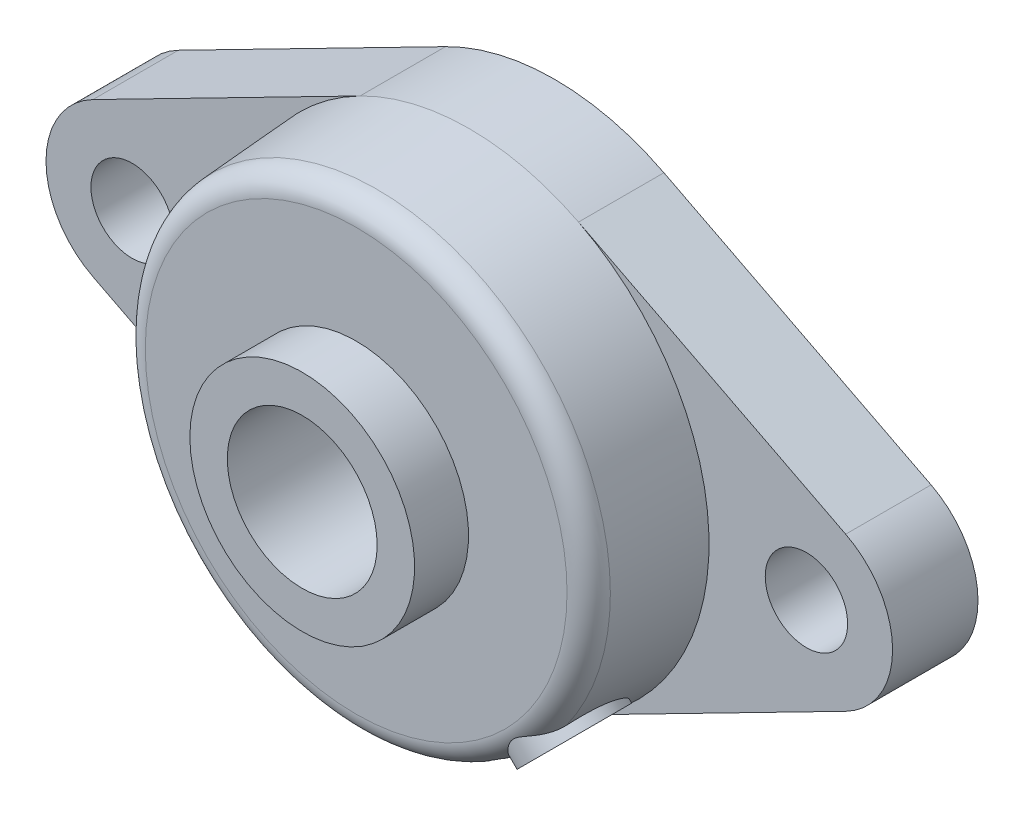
ISO-10303-21;
HEADER;
FILE_DESCRIPTION(('STEP AP214'),'2;1');
FILE_NAME('part.step','',(''),(''),'','','');
FILE_SCHEMA(('AUTOMOTIVE_DESIGN { 1 0 10303 214 1 1 1 1 }'));
ENDSEC;
DATA;
#1=APPLICATION_CONTEXT('core data for automotive mechanical design processes');
#2=APPLICATION_PROTOCOL_DEFINITION('international standard','automotive_design',2000,#1);
#3=PRODUCT_CONTEXT('',#1,'mechanical');
#4=PRODUCT('Part','Part','',(#3));
#5=PRODUCT_RELATED_PRODUCT_CATEGORY('part','',(#4));
#6=PRODUCT_DEFINITION_FORMATION('','',#4);
#7=PRODUCT_DEFINITION_CONTEXT('part definition',#1,'design');
#8=PRODUCT_DEFINITION('design','',#6,#7);
#9=PRODUCT_DEFINITION_SHAPE('','',#8);
#10=(LENGTH_UNIT() NAMED_UNIT(*) SI_UNIT(.MILLI.,.METRE.));
#11=(NAMED_UNIT(*) PLANE_ANGLE_UNIT() SI_UNIT($,.RADIAN.));
#12=(NAMED_UNIT(*) SI_UNIT($,.STERADIAN.) SOLID_ANGLE_UNIT());
#13=UNCERTAINTY_MEASURE_WITH_UNIT(LENGTH_MEASURE(1.E-05),#10,'distance_accuracy_value','');
#14=(GEOMETRIC_REPRESENTATION_CONTEXT(3) GLOBAL_UNCERTAINTY_ASSIGNED_CONTEXT((#13)) GLOBAL_UNIT_ASSIGNED_CONTEXT((#10,
#11,#12)) REPRESENTATION_CONTEXT('',''));
#15=CARTESIAN_POINT('',(0.,0.,0.));
#16=DIRECTION('',(0.,0.,1.));
#17=DIRECTION('',(1.,0.,0.));
#18=AXIS2_PLACEMENT_3D('',#15,#16,#17);
#19=CARTESIAN_POINT('',(0.,0.,26.5));
#20=DIRECTION('',(0.,0.,0.999999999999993));
#21=DIRECTION('',(1.,0.,0.));
#22=AXIS2_PLACEMENT_3D('',#19,#20,#21);
#23=PLANE('',#22);
#24=CARTESIAN_POINT('',(0.,0.,26.5));
#25=DIRECTION('',(0.,0.,0.999999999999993));
#26=DIRECTION('',(1.,0.,0.));
#27=AXIS2_PLACEMENT_3D('',#24,#25,#26);
#28=CIRCLE('',#27,28.14655988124);
#29=CARTESIAN_POINT('',(28.14655988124,0.,26.5));
#30=VERTEX_POINT('',#29);
#31=EDGE_CURVE('E158',#30,#30,#28,.T.);
#32=ORIENTED_EDGE('',*,*,#31,.T.);
#33=EDGE_LOOP('',(#32));
#34=FACE_BOUND('',#33,.T.);
#35=CARTESIAN_POINT('',(0.,0.,26.5));
#36=DIRECTION('',(0.,0.,0.999999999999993));
#37=DIRECTION('',(1.,0.,0.));
#38=AXIS2_PLACEMENT_3D('',#35,#36,#37);
#39=CIRCLE('',#38,15.);
#40=CARTESIAN_POINT('',(-15.,0.,26.5));
#41=VERTEX_POINT('',#40);
#42=EDGE_CURVE('E236',#41,#41,#39,.F.);
#43=ORIENTED_EDGE('',*,*,#42,.T.);
#44=EDGE_LOOP('',(#43));
#45=FACE_BOUND('',#44,.T.);
#46=ADVANCED_FACE('F36',(#34,#45),#23,.T.);
#47=CARTESIAN_POINT('',(0.,-2.22044604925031E-13,6.00000000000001));
#48=DIRECTION('',(0.,0.,-0.999999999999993));
#49=DIRECTION('',(-1.,0.,0.));
#50=AXIS2_PLACEMENT_3D('',#47,#48,#49);
#51=PLANE('',#50);
#52=CARTESIAN_POINT('',(0.,-2.22044604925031E-13,6.00000000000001));
#53=DIRECTION('',(0.,0.,-0.999999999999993));
#54=DIRECTION('',(-1.,0.,0.));
#55=AXIS2_PLACEMENT_3D('',#52,#53,#54);
#56=CIRCLE('',#55,26.);
#57=CARTESIAN_POINT('',(-26.0000000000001,-2.22044604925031E-13,6.));
#58=VERTEX_POINT('',#57);
#59=EDGE_CURVE('E257',#58,#58,#56,.T.);
#60=ORIENTED_EDGE('',*,*,#59,.T.);
#61=EDGE_LOOP('',(#60));
#62=FACE_BOUND('',#61,.T.);
#63=CARTESIAN_POINT('',(0.,-2.22044604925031E-13,6.00000000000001));
#64=DIRECTION('',(0.,0.,-0.999999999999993));
#65=DIRECTION('',(-1.,0.,0.));
#66=AXIS2_PLACEMENT_3D('',#63,#64,#65);
#67=CIRCLE('',#66,15.);
#68=CARTESIAN_POINT('',(-15.,0.,6.));
#69=VERTEX_POINT('',#68);
#70=EDGE_CURVE('E233',#69,#69,#67,.F.);
#71=ORIENTED_EDGE('',*,*,#70,.T.);
#72=EDGE_LOOP('',(#71));
#73=FACE_BOUND('',#72,.T.);
#74=ADVANCED_FACE('F349',(#62,#73),#51,.T.);
#75=CARTESIAN_POINT('',(45.0000000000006,-6.66133814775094E-13,11.3999999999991));
#76=DIRECTION('',(0.,0.,0.999999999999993));
#77=DIRECTION('',(1.,0.,0.));
#78=AXIS2_PLACEMENT_3D('',#75,#76,#77);
#79=PLANE('',#78);
#80=CARTESIAN_POINT('',(0.,-2.22044604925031E-13,11.4));
#81=DIRECTION('',(0.,0.,0.999999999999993));
#82=DIRECTION('',(1.,0.,0.));
#83=AXIS2_PLACEMENT_3D('',#80,#81,#82);
#84=CIRCLE('',#83,32.);
#85=CARTESIAN_POINT('',(-14.5777777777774,28.4866353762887,11.4));
#86=VERTEX_POINT('',#85);
#87=CARTESIAN_POINT('',(-14.5777777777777,-28.4866353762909,11.4000000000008));
#88=VERTEX_POINT('',#87);
#89=EDGE_CURVE('E124',#86,#88,#84,.T.);
#90=ORIENTED_EDGE('',*,*,#89,.F.);
#91=DIRECTION('',(-0.89020735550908,-0.455555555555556,0.));
#92=VECTOR('',#91,1.);
#93=CARTESIAN_POINT('',(-50.2388888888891,10.237384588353,11.4000000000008));
#94=LINE('',#93,#92);
#95=CARTESIAN_POINT('',(-50.2388888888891,10.237384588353,11.4000000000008));
#96=VERTEX_POINT('',#95);
#97=EDGE_CURVE('E227',#86,#96,#94,.T.);
#98=ORIENTED_EDGE('',*,*,#97,.T.);
#99=CARTESIAN_POINT('',(-44.9999999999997,-1.11022302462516E-12,11.4));
#100=DIRECTION('',(0.,0.,0.999999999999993));
#101=DIRECTION('',(1.,0.,0.));
#102=AXIS2_PLACEMENT_3D('',#99,#100,#101);
#103=CIRCLE('',#102,11.5);
#104=CARTESIAN_POINT('',(-50.2388888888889,-10.2373845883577,11.4));
#105=VERTEX_POINT('',#104);
#106=EDGE_CURVE('E127',#96,#105,#103,.T.);
#107=ORIENTED_EDGE('',*,*,#106,.T.);
#108=DIRECTION('',(0.89020735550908,-0.455555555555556,0.));
#109=VECTOR('',#108,1.);
#110=CARTESIAN_POINT('',(-50.2388888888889,-10.2373845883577,11.4));
#111=LINE('',#110,#109);
#112=EDGE_CURVE('E119',#105,#88,#111,.T.);
#113=ORIENTED_EDGE('',*,*,#112,.T.);
#114=EDGE_LOOP('',(#90,#98,#107,#113));
#115=FACE_BOUND('',#114,.T.);
#116=CARTESIAN_POINT('',(-44.9999999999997,-1.11022302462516E-12,11.4));
#117=DIRECTION('',(0.,0.,0.999999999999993));
#118=DIRECTION('',(1.,0.,0.));
#119=AXIS2_PLACEMENT_3D('',#116,#117,#118);
#120=CIRCLE('',#119,5.5);
#121=CARTESIAN_POINT('',(-50.4999999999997,-1.11022302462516E-12,11.4));
#122=VERTEX_POINT('',#121);
#123=EDGE_CURVE('E271',#122,#122,#120,.T.);
#124=ORIENTED_EDGE('',*,*,#123,.F.);
#125=EDGE_LOOP('',(#124));
#126=FACE_BOUND('',#125,.T.);
#127=ADVANCED_FACE('F121',(#115,#126),#79,.T.);
#128=CARTESIAN_POINT('',(14.5777777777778,-28.4866353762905,11.4));
#129=VERTEX_POINT('',#128);
#130=CARTESIAN_POINT('',(14.5777777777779,28.4866353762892,11.4));
#131=VERTEX_POINT('',#130);
#132=EDGE_CURVE('E159',#129,#131,#84,.T.);
#133=ORIENTED_EDGE('',*,*,#132,.F.);
#134=DIRECTION('',(0.89020735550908,0.455555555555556,0.));
#135=VECTOR('',#134,1.);
#136=CARTESIAN_POINT('',(14.5777777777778,-28.4866353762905,11.4));
#137=LINE('',#136,#135);
#138=CARTESIAN_POINT('',(50.2388888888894,-10.237384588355,11.4));
#139=VERTEX_POINT('',#138);
#140=EDGE_CURVE('E63',#129,#139,#137,.T.);
#141=ORIENTED_EDGE('',*,*,#140,.T.);
#142=CARTESIAN_POINT('',(45.0000000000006,-6.66133814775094E-13,11.3999999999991));
#143=DIRECTION('',(0.,0.,0.999999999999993));
#144=DIRECTION('',(1.,0.,0.));
#145=AXIS2_PLACEMENT_3D('',#142,#143,#144);
#146=CIRCLE('',#145,11.5);
#147=CARTESIAN_POINT('',(50.2388888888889,10.2373845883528,11.4));
#148=VERTEX_POINT('',#147);
#149=EDGE_CURVE('E278',#139,#148,#146,.T.);
#150=ORIENTED_EDGE('',*,*,#149,.T.);
#151=DIRECTION('',(-0.89020735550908,0.455555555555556,0.));
#152=VECTOR('',#151,1.);
#153=CARTESIAN_POINT('',(14.5777777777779,28.4866353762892,11.4));
#154=LINE('',#153,#152);
#155=EDGE_CURVE('E105',#148,#131,#154,.T.);
#156=ORIENTED_EDGE('',*,*,#155,.T.);
#157=EDGE_LOOP('',(#133,#141,#150,#156));
#158=FACE_BOUND('',#157,.T.);
#159=CARTESIAN_POINT('',(45.0000000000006,-6.66133814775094E-13,11.3999999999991));
#160=DIRECTION('',(0.,0.,0.999999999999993));
#161=DIRECTION('',(1.,0.,0.));
#162=AXIS2_PLACEMENT_3D('',#159,#160,#161);
#163=CIRCLE('',#162,5.49999999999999);
#164=CARTESIAN_POINT('',(39.5000000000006,-6.66133814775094E-13,11.3999999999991));
#165=VERTEX_POINT('',#164);
#166=EDGE_CURVE('E264',#165,#165,#163,.T.);
#167=ORIENTED_EDGE('',*,*,#166,.F.);
#168=EDGE_LOOP('',(#167));
#169=FACE_BOUND('',#168,.T.);
#170=ADVANCED_FACE('F536',(#158,#169),#79,.T.);
#171=CARTESIAN_POINT('',(45.0000000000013,-1.33226762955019E-12,-8.32667268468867E-13));
#172=DIRECTION('',(0.,0.,0.999999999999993));
#173=DIRECTION('',(1.,0.,0.));
#174=AXIS2_PLACEMENT_3D('',#171,#172,#173);
#175=PLANE('',#174);
#176=CARTESIAN_POINT('',(9.99200722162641E-13,-2.22044604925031E-12,0.));
#177=DIRECTION('',(0.,0.,-0.999999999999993));
#178=DIRECTION('',(-1.,0.,0.));
#179=AXIS2_PLACEMENT_3D('',#176,#177,#178);
#180=CIRCLE('',#179,26.);
#181=CARTESIAN_POINT('',(-26.0000000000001,-2.22435087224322E-13,0.));
#182=VERTEX_POINT('',#181);
#183=EDGE_CURVE('E242',#182,#182,#180,.T.);
#184=ORIENTED_EDGE('',*,*,#183,.F.);
#185=EDGE_LOOP('',(#184));
#186=FACE_BOUND('',#185,.T.);
#187=CARTESIAN_POINT('',(-45.0000000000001,-6.66133814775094E-13,0.));
#188=DIRECTION('',(0.,0.,0.999999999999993));
#189=DIRECTION('',(1.,0.,0.));
#190=AXIS2_PLACEMENT_3D('',#187,#188,#189);
#191=CIRCLE('',#190,5.5);
#192=CARTESIAN_POINT('',(-50.4999999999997,-1.11096494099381E-12,0.));
#193=VERTEX_POINT('',#192);
#194=EDGE_CURVE('E267',#193,#193,#191,.T.);
#195=ORIENTED_EDGE('',*,*,#194,.T.);
#196=EDGE_LOOP('',(#195));
#197=FACE_BOUND('',#196,.T.);
#198=CARTESIAN_POINT('',(45.0000000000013,-1.33226762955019E-12,-8.32667268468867E-13));
#199=DIRECTION('',(0.,0.,0.999999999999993));
#200=DIRECTION('',(1.,0.,0.));
#201=AXIS2_PLACEMENT_3D('',#198,#199,#200);
#202=CIRCLE('',#201,11.5);
#203=CARTESIAN_POINT('',(50.2388888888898,-10.2373845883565,0.));
#204=VERTEX_POINT('',#203);
#205=CARTESIAN_POINT('',(50.2388888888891,10.237384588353,0.));
#206=VERTEX_POINT('',#205);
#207=EDGE_CURVE('E275',#204,#206,#202,.T.);
#208=ORIENTED_EDGE('',*,*,#207,.F.);
#209=DIRECTION('',(0.89020735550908,0.455555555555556,0.));
#210=VECTOR('',#209,1.);
#211=CARTESIAN_POINT('',(14.5777777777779,-28.4866353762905,-8.32667268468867E-13));
#212=LINE('',#211,#210);
#213=CARTESIAN_POINT('',(14.5777777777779,-28.4866353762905,-8.32667268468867E-13));
#214=VERTEX_POINT('',#213);
#215=EDGE_CURVE('E96',#214,#204,#212,.T.);
#216=ORIENTED_EDGE('',*,*,#215,.F.);
#217=CARTESIAN_POINT('',(9.99200722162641E-13,-2.22044604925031E-12,0.));
#218=DIRECTION('',(0.,0.,0.999999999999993));
#219=DIRECTION('',(1.,0.,0.));
#220=AXIS2_PLACEMENT_3D('',#217,#218,#219);
#221=CIRCLE('',#220,32.);
#222=CARTESIAN_POINT('',(-14.5777777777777,-28.4866353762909,8.32667268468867E-13));
#223=VERTEX_POINT('',#222);
#224=EDGE_CURVE('E297',#223,#214,#221,.T.);
#225=ORIENTED_EDGE('',*,*,#224,.F.);
#226=DIRECTION('',(0.89020735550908,-0.455555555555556,0.));
#227=VECTOR('',#226,1.);
#228=CARTESIAN_POINT('',(-50.2388888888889,-10.2373845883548,0.));
#229=LINE('',#228,#227);
#230=CARTESIAN_POINT('',(-50.2388888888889,-10.2373845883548,0.));
#231=VERTEX_POINT('',#230);
#232=EDGE_CURVE('E139',#231,#223,#229,.T.);
#233=ORIENTED_EDGE('',*,*,#232,.F.);
#234=CARTESIAN_POINT('',(-45.0000000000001,-6.66133814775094E-13,0.));
#235=DIRECTION('',(0.,0.,0.999999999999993));
#236=DIRECTION('',(1.,0.,0.));
#237=AXIS2_PLACEMENT_3D('',#234,#235,#236);
#238=CIRCLE('',#237,11.5);
#239=CARTESIAN_POINT('',(-50.238888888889,10.237384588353,8.32667268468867E-13));
#240=VERTEX_POINT('',#239);
#241=EDGE_CURVE('E293',#240,#231,#238,.T.);
#242=ORIENTED_EDGE('',*,*,#241,.F.);
#243=DIRECTION('',(-0.89020735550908,-0.455555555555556,0.));
#244=VECTOR('',#243,1.);
#245=CARTESIAN_POINT('',(-50.238888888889,10.237384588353,8.32667268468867E-13));
#246=LINE('',#245,#244);
#247=CARTESIAN_POINT('',(-14.5777777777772,28.4866353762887,8.32667268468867E-13));
#248=VERTEX_POINT('',#247);
#249=EDGE_CURVE('E290',#248,#240,#246,.T.);
#250=ORIENTED_EDGE('',*,*,#249,.F.);
#251=CARTESIAN_POINT('',(9.99200722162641E-13,-2.22044604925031E-12,0.));
#252=DIRECTION('',(0.,0.,0.999999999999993));
#253=DIRECTION('',(1.,0.,0.));
#254=AXIS2_PLACEMENT_3D('',#251,#252,#253);
#255=CIRCLE('',#254,32.);
#256=CARTESIAN_POINT('',(14.5777777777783,28.48663537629,0.));
#257=VERTEX_POINT('',#256);
#258=EDGE_CURVE('E288',#257,#248,#255,.T.);
#259=ORIENTED_EDGE('',*,*,#258,.F.);
#260=DIRECTION('',(-0.89020735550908,0.455555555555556,0.));
#261=VECTOR('',#260,1.);
#262=CARTESIAN_POINT('',(14.5777777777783,28.48663537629,0.));
#263=LINE('',#262,#261);
#264=EDGE_CURVE('E285',#206,#257,#263,.T.);
#265=ORIENTED_EDGE('',*,*,#264,.F.);
#266=EDGE_LOOP('',(#208,#216,#225,#233,#242,#250,#259,#265));
#267=FACE_BOUND('',#266,.T.);
#268=CARTESIAN_POINT('',(45.0000000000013,-1.33226762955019E-12,-8.32667268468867E-13));
#269=DIRECTION('',(0.,0.,0.999999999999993));
#270=DIRECTION('',(1.,0.,0.));
#271=AXIS2_PLACEMENT_3D('',#268,#269,#270);
#272=CIRCLE('',#271,5.49999999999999);
#273=CARTESIAN_POINT('',(39.5000000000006,-6.66875731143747E-13,-8.32667268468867E-13));
#274=VERTEX_POINT('',#273);
#275=EDGE_CURVE('E261',#274,#274,#272,.T.);
#276=ORIENTED_EDGE('',*,*,#275,.T.);
#277=EDGE_LOOP('',(#276));
#278=FACE_BOUND('',#277,.T.);
#279=ADVANCED_FACE('F528',(#186,#197,#267,#278),#175,.F.);
#280=CARTESIAN_POINT('',(45.0000000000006,-6.66133814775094E-13,11.3999999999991));
#281=DIRECTION('',(0.,0.,-0.999999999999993));
#282=DIRECTION('',(-1.,0.,0.));
#283=AXIS2_PLACEMENT_3D('',#280,#281,#282);
#284=CYLINDRICAL_SURFACE('',#283,11.5);
#285=ORIENTED_EDGE('',*,*,#207,.T.);
#286=DIRECTION('',(0.,0.,-0.999999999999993));
#287=VECTOR('',#286,1.);
#288=CARTESIAN_POINT('',(50.2388888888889,10.2373845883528,11.4));
#289=LINE('',#288,#287);
#290=EDGE_CURVE('E165',#148,#206,#289,.T.);
#291=ORIENTED_EDGE('',*,*,#290,.F.);
#292=ORIENTED_EDGE('',*,*,#149,.F.);
#293=DIRECTION('',(0.,0.,-0.999999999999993));
#294=VECTOR('',#293,1.);
#295=CARTESIAN_POINT('',(50.2388888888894,-10.237384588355,11.4));
#296=LINE('',#295,#294);
#297=EDGE_CURVE('E186',#139,#204,#296,.T.);
#298=ORIENTED_EDGE('',*,*,#297,.T.);
#299=EDGE_LOOP('',(#285,#291,#292,#298));
#300=FACE_BOUND('',#299,.T.);
#301=ADVANCED_FACE('F519',(#300),#284,.T.);
#302=CARTESIAN_POINT('',(14.5777777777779,28.4866353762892,11.4));
#303=DIRECTION('',(-0.455555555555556,-0.89020735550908,0.));
#304=DIRECTION('',(0.89020735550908,-0.455555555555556,0.));
#305=AXIS2_PLACEMENT_3D('',#302,#303,#304);
#306=PLANE('',#305);
#307=ORIENTED_EDGE('',*,*,#264,.T.);
#308=DIRECTION('',(0.,0.,-0.999999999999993));
#309=VECTOR('',#308,1.);
#310=CARTESIAN_POINT('',(14.5777777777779,28.4866353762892,11.4));
#311=LINE('',#310,#309);
#312=EDGE_CURVE('E214',#131,#257,#311,.T.);
#313=ORIENTED_EDGE('',*,*,#312,.F.);
#314=ORIENTED_EDGE('',*,*,#155,.F.);
#315=ORIENTED_EDGE('',*,*,#290,.T.);
#316=EDGE_LOOP('',(#307,#313,#314,#315));
#317=FACE_BOUND('',#316,.T.);
#318=ADVANCED_FACE('F509',(#317),#306,.F.);
#319=CARTESIAN_POINT('',(0.,-2.22044604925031E-13,11.4));
#320=DIRECTION('',(0.,0.,-0.999999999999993));
#321=DIRECTION('',(-1.,0.,0.));
#322=AXIS2_PLACEMENT_3D('',#319,#320,#321);
#323=CYLINDRICAL_SURFACE('',#322,32.);
#324=ORIENTED_EDGE('',*,*,#258,.T.);
#325=DIRECTION('',(0.,0.,-0.999999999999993));
#326=VECTOR('',#325,1.);
#327=CARTESIAN_POINT('',(-14.5777777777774,28.4866353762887,11.4));
#328=LINE('',#327,#326);
#329=EDGE_CURVE('E206',#86,#248,#328,.T.);
#330=ORIENTED_EDGE('',*,*,#329,.F.);
#331=CARTESIAN_POINT('',(0.,-2.22044604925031E-13,11.4));
#332=DIRECTION('',(0.,0.,0.999999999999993));
#333=DIRECTION('',(1.,0.,0.));
#334=AXIS2_PLACEMENT_3D('',#331,#332,#333);
#335=CIRCLE('',#334,32.);
#336=EDGE_CURVE('E156',#131,#86,#335,.T.);
#337=ORIENTED_EDGE('',*,*,#336,.F.);
#338=ORIENTED_EDGE('',*,*,#312,.T.);
#339=EDGE_LOOP('',(#324,#330,#337,#338));
#340=FACE_BOUND('',#339,.T.);
#341=ADVANCED_FACE('F500',(#340),#323,.T.);
#342=CARTESIAN_POINT('',(-50.2388888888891,10.237384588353,11.4000000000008));
#343=DIRECTION('',(0.455555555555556,-0.89020735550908,0.));
#344=DIRECTION('',(0.89020735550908,0.455555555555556,0.));
#345=AXIS2_PLACEMENT_3D('',#342,#343,#344);
#346=PLANE('',#345);
#347=ORIENTED_EDGE('',*,*,#249,.T.);
#348=DIRECTION('',(0.,0.,-0.999999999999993));
#349=VECTOR('',#348,1.);
#350=CARTESIAN_POINT('',(-50.2388888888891,10.237384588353,11.4000000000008));
#351=LINE('',#350,#349);
#352=EDGE_CURVE('E203',#96,#240,#351,.T.);
#353=ORIENTED_EDGE('',*,*,#352,.F.);
#354=ORIENTED_EDGE('',*,*,#97,.F.);
#355=ORIENTED_EDGE('',*,*,#329,.T.);
#356=EDGE_LOOP('',(#347,#353,#354,#355));
#357=FACE_BOUND('',#356,.T.);
#358=ADVANCED_FACE('F491',(#357),#346,.F.);
#359=CARTESIAN_POINT('',(-44.9999999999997,-1.11022302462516E-12,11.4));
#360=DIRECTION('',(0.,0.,-0.999999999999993));
#361=DIRECTION('',(-1.,0.,0.));
#362=AXIS2_PLACEMENT_3D('',#359,#360,#361);
#363=CYLINDRICAL_SURFACE('',#362,11.5);
#364=ORIENTED_EDGE('',*,*,#241,.T.);
#365=DIRECTION('',(0.,0.,-0.999999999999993));
#366=VECTOR('',#365,1.);
#367=CARTESIAN_POINT('',(-50.2388888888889,-10.2373845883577,11.4));
#368=LINE('',#367,#366);
#369=EDGE_CURVE('E143',#105,#231,#368,.T.);
#370=ORIENTED_EDGE('',*,*,#369,.F.);
#371=ORIENTED_EDGE('',*,*,#106,.F.);
#372=ORIENTED_EDGE('',*,*,#352,.T.);
#373=EDGE_LOOP('',(#364,#370,#371,#372));
#374=FACE_BOUND('',#373,.T.);
#375=ADVANCED_FACE('F482',(#374),#363,.T.);
#376=CARTESIAN_POINT('',(-50.2388888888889,-10.2373845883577,11.4));
#377=DIRECTION('',(0.455555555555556,0.89020735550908,0.));
#378=DIRECTION('',(-0.89020735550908,0.455555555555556,0.));
#379=AXIS2_PLACEMENT_3D('',#376,#377,#378);
#380=PLANE('',#379);
#381=ORIENTED_EDGE('',*,*,#232,.T.);
#382=DIRECTION('',(0.,0.,-0.999999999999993));
#383=VECTOR('',#382,1.);
#384=CARTESIAN_POINT('',(-14.5777777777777,-28.4866353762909,11.4000000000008));
#385=LINE('',#384,#383);
#386=EDGE_CURVE('E135',#88,#223,#385,.T.);
#387=ORIENTED_EDGE('',*,*,#386,.F.);
#388=ORIENTED_EDGE('',*,*,#112,.F.);
#389=ORIENTED_EDGE('',*,*,#369,.T.);
#390=EDGE_LOOP('',(#381,#387,#388,#389));
#391=FACE_BOUND('',#390,.T.);
#392=ADVANCED_FACE('F137',(#391),#380,.F.);
#393=CARTESIAN_POINT('',(0.,-2.22044604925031E-13,11.4));
#394=DIRECTION('',(0.,0.,-0.999999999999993));
#395=DIRECTION('',(-1.,0.,0.));
#396=AXIS2_PLACEMENT_3D('',#393,#394,#395);
#397=CYLINDRICAL_SURFACE('',#396,32.);
#398=ORIENTED_EDGE('',*,*,#224,.T.);
#399=DIRECTION('',(0.,0.,-0.999999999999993));
#400=VECTOR('',#399,1.);
#401=CARTESIAN_POINT('',(14.5777777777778,-28.4866353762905,11.4));
#402=LINE('',#401,#400);
#403=EDGE_CURVE('E144',#129,#214,#402,.T.);
#404=ORIENTED_EDGE('',*,*,#403,.F.);
#405=CARTESIAN_POINT('',(0.,-2.22044604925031E-13,11.4));
#406=DIRECTION('',(0.,0.,0.999999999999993));
#407=DIRECTION('',(1.,0.,0.));
#408=AXIS2_PLACEMENT_3D('',#405,#406,#407);
#409=CIRCLE('',#408,32.);
#410=EDGE_CURVE('E132',#88,#129,#409,.T.);
#411=ORIENTED_EDGE('',*,*,#410,.F.);
#412=ORIENTED_EDGE('',*,*,#386,.T.);
#413=EDGE_LOOP('',(#398,#404,#411,#412));
#414=FACE_BOUND('',#413,.T.);
#415=ADVANCED_FACE('F148',(#414),#397,.T.);
#416=CARTESIAN_POINT('',(14.5777777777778,-28.4866353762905,11.4));
#417=DIRECTION('',(-0.455555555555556,0.89020735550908,0.));
#418=DIRECTION('',(-0.89020735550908,-0.455555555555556,0.));
#419=AXIS2_PLACEMENT_3D('',#416,#417,#418);
#420=PLANE('',#419);
#421=ORIENTED_EDGE('',*,*,#215,.T.);
#422=ORIENTED_EDGE('',*,*,#297,.F.);
#423=ORIENTED_EDGE('',*,*,#140,.F.);
#424=ORIENTED_EDGE('',*,*,#403,.T.);
#425=EDGE_LOOP('',(#421,#422,#423,#424));
#426=FACE_BOUND('',#425,.T.);
#427=ADVANCED_FACE('F456',(#426),#420,.F.);
#428=CARTESIAN_POINT('',(-44.9999999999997,-1.11022302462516E-12,11.4));
#429=DIRECTION('',(0.,0.,-0.999999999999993));
#430=DIRECTION('',(-1.,0.,0.));
#431=AXIS2_PLACEMENT_3D('',#428,#429,#430);
#432=CYLINDRICAL_SURFACE('',#431,5.5);
#433=CARTESIAN_POINT('',(-50.4999999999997,-1.11022302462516E-12,11.4));
#434=CARTESIAN_POINT('',(-50.4999999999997,-1.11023075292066E-12,11.28125));
#435=CARTESIAN_POINT('',(-50.4999999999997,-1.11023848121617E-12,11.1625));
#436=CARTESIAN_POINT('',(-50.4999999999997,-1.11025393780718E-12,10.925));
#437=CARTESIAN_POINT('',(-50.4999999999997,-1.11026166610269E-12,10.80625));
#438=CARTESIAN_POINT('',(-50.4999999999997,-1.1102771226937E-12,10.56875));
#439=CARTESIAN_POINT('',(-50.4999999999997,-1.11028485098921E-12,10.45));
#440=CARTESIAN_POINT('',(-50.4999999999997,-1.11030030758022E-12,10.2125));
#441=CARTESIAN_POINT('',(-50.4999999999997,-1.11030803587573E-12,10.09375));
#442=CARTESIAN_POINT('',(-50.4999999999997,-1.11032349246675E-12,9.85625000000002));
#443=CARTESIAN_POINT('',(-50.4999999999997,-1.11033122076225E-12,9.73750000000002));
#444=CARTESIAN_POINT('',(-50.4999999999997,-1.11034667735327E-12,9.50000000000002));
#445=CARTESIAN_POINT('',(-50.4999999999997,-1.11035440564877E-12,9.38125000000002));
#446=CARTESIAN_POINT('',(-50.4999999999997,-1.11036986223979E-12,9.14375000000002));
#447=CARTESIAN_POINT('',(-50.4999999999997,-1.11037759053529E-12,9.02500000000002));
#448=CARTESIAN_POINT('',(-50.4999999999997,-1.11039304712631E-12,8.78750000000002));
#449=CARTESIAN_POINT('',(-50.4999999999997,-1.11040077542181E-12,8.66875000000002));
#450=CARTESIAN_POINT('',(-50.4999999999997,-1.11041623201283E-12,8.43125000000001));
#451=CARTESIAN_POINT('',(-50.4999999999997,-1.11042396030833E-12,8.31250000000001));
#452=CARTESIAN_POINT('',(-50.4999999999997,-1.11043941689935E-12,8.07500000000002));
#453=CARTESIAN_POINT('',(-50.4999999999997,-1.11044714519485E-12,7.95625000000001));
#454=CARTESIAN_POINT('',(-50.4999999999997,-1.11046260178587E-12,7.71875000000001));
#455=CARTESIAN_POINT('',(-50.4999999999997,-1.11047033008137E-12,7.60000000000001));
#456=CARTESIAN_POINT('',(-50.4999999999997,-1.11048578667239E-12,7.36250000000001));
#457=CARTESIAN_POINT('',(-50.4999999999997,-1.11049351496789E-12,7.24375000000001));
#458=CARTESIAN_POINT('',(-50.4999999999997,-1.11050897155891E-12,7.00625000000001));
#459=CARTESIAN_POINT('',(-50.4999999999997,-1.11051669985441E-12,6.88750000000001));
#460=CARTESIAN_POINT('',(-50.4999999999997,-1.11053215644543E-12,6.65000000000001));
#461=CARTESIAN_POINT('',(-50.4999999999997,-1.11053988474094E-12,6.53125000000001));
#462=CARTESIAN_POINT('',(-50.4999999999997,-1.11055534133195E-12,6.29375000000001));
#463=CARTESIAN_POINT('',(-50.4999999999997,-1.11056306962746E-12,6.17500000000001));
#464=CARTESIAN_POINT('',(-50.4999999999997,-1.11057852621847E-12,5.93750000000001));
#465=CARTESIAN_POINT('',(-50.4999999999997,-1.11058625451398E-12,5.81875000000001));
#466=CARTESIAN_POINT('',(-50.4999999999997,-1.11060171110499E-12,5.58125000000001));
#467=CARTESIAN_POINT('',(-50.4999999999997,-1.1106094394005E-12,5.46250000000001));
#468=CARTESIAN_POINT('',(-50.4999999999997,-1.11062489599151E-12,5.22500000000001));
#469=CARTESIAN_POINT('',(-50.4999999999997,-1.11063262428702E-12,5.10625000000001));
#470=CARTESIAN_POINT('',(-50.4999999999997,-1.11064808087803E-12,4.86875000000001));
#471=CARTESIAN_POINT('',(-50.4999999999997,-1.11065580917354E-12,4.75000000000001));
#472=CARTESIAN_POINT('',(-50.4999999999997,-1.11067126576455E-12,4.51250000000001));
#473=CARTESIAN_POINT('',(-50.4999999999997,-1.11067899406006E-12,4.39375000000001));
#474=CARTESIAN_POINT('',(-50.4999999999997,-1.11069445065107E-12,4.15625000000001));
#475=CARTESIAN_POINT('',(-50.4999999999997,-1.11070217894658E-12,4.03750000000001));
#476=CARTESIAN_POINT('',(-50.4999999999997,-1.11071763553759E-12,3.80000000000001));
#477=CARTESIAN_POINT('',(-50.4999999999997,-1.1107253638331E-12,3.68125000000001));
#478=CARTESIAN_POINT('',(-50.4999999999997,-1.11074082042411E-12,3.44375000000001));
#479=CARTESIAN_POINT('',(-50.4999999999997,-1.11074854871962E-12,3.32500000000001));
#480=CARTESIAN_POINT('',(-50.4999999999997,-1.11076400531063E-12,3.0875));
#481=CARTESIAN_POINT('',(-50.4999999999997,-1.11077173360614E-12,2.96875));
#482=CARTESIAN_POINT('',(-50.4999999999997,-1.11078719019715E-12,2.73125000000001));
#483=CARTESIAN_POINT('',(-50.4999999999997,-1.11079491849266E-12,2.61250000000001));
#484=CARTESIAN_POINT('',(-50.4999999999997,-1.11081037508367E-12,2.375));
#485=CARTESIAN_POINT('',(-50.4999999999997,-1.11081810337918E-12,2.25625));
#486=CARTESIAN_POINT('',(-50.4999999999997,-1.11083355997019E-12,2.01875));
#487=CARTESIAN_POINT('',(-50.4999999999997,-1.1108412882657E-12,1.9));
#488=CARTESIAN_POINT('',(-50.4999999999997,-1.11085674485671E-12,1.6625));
#489=CARTESIAN_POINT('',(-50.4999999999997,-1.11086447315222E-12,1.54375));
#490=CARTESIAN_POINT('',(-50.4999999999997,-1.11087992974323E-12,1.30625));
#491=CARTESIAN_POINT('',(-50.4999999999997,-1.11088765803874E-12,1.1875));
#492=CARTESIAN_POINT('',(-50.4999999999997,-1.11090311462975E-12,0.950000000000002));
#493=CARTESIAN_POINT('',(-50.4999999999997,-1.11091084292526E-12,0.831250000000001));
#494=CARTESIAN_POINT('',(-50.4999999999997,-1.11092629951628E-12,0.593750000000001));
#495=CARTESIAN_POINT('',(-50.4999999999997,-1.11093402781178E-12,0.475));
#496=CARTESIAN_POINT('',(-50.4999999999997,-1.1109494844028E-12,0.237499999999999));
#497=CARTESIAN_POINT('',(-50.4999999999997,-1.1109572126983E-12,0.11875));
#498=CARTESIAN_POINT('',(-50.4999999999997,-1.11096494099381E-12,0.));
#499=B_SPLINE_CURVE_WITH_KNOTS('',3,(#433,#434,#435,#436,#437,#438,#439,#440,#441,#442,#443,
#444,#445,#446,#447,#448,#449,#450,#451,#452,#453,#454,#455,#456,#457,#458,#459,#460,#461,#462,
#463,#464,#465,#466,#467,#468,#469,#470,#471,#472,#473,#474,#475,#476,#477,#478,#479,#480,#481,
#482,#483,#484,#485,#486,#487,#488,#489,#490,#491,#492,#493,#494,#495,#496,#497,#498),
.UNSPECIFIED.,.F.,.F.,(4,2,2,2,2,2,2,2,2,2,2,2,2,2,2,2,2,2,2,2,2,2,2,2,2,2,2,2,2,2,2,2,4),(0.,
0.356250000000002,0.712500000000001,1.06875,1.425,1.78125000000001,2.1375,2.49375000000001,
2.85000000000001,3.20625000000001,3.56250000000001,3.91875000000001,4.27500000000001,
4.63125000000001,4.98750000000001,5.34375000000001,5.70000000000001,6.05625000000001,
6.41250000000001,6.76875000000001,7.12500000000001,7.48125000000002,7.83750000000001,
8.19375000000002,8.55000000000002,8.90625000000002,9.26250000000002,9.61875000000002,
9.97500000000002,10.33125,10.6875,11.04375,11.4),.UNSPECIFIED.);
#500=EDGE_CURVE('BSEAM447',#122,#193,#499,.T.);
#501=ORIENTED_EDGE('',*,*,#123,.T.);
#502=ORIENTED_EDGE('',*,*,#194,.F.);
#503=ORIENTED_EDGE('',*,*,#500,.T.);
#504=ORIENTED_EDGE('',*,*,#500,.F.);
#505=EDGE_LOOP('',(#501,#503,#502,#504));
#506=FACE_BOUND('',#505,.T.);
#507=ADVANCED_FACE('F447',(#506),#432,.F.);
#508=CARTESIAN_POINT('',(45.0000000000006,-6.66133814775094E-13,11.3999999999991));
#509=DIRECTION('',(0.,0.,-0.999999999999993));
#510=DIRECTION('',(-1.,0.,0.));
#511=AXIS2_PLACEMENT_3D('',#508,#509,#510);
#512=CYLINDRICAL_SURFACE('',#511,5.49999999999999);
#513=CARTESIAN_POINT('',(39.5000000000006,-6.66133814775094E-13,11.3999999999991));
#514=CARTESIAN_POINT('',(39.5000000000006,-6.66141543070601E-13,11.2812499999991));
#515=CARTESIAN_POINT('',(39.5000000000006,-6.66149271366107E-13,11.1624999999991));
#516=CARTESIAN_POINT('',(39.5000000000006,-6.66164727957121E-13,10.9249999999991));
#517=CARTESIAN_POINT('',(39.5000000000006,-6.66172456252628E-13,10.8062499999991));
#518=CARTESIAN_POINT('',(39.5000000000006,-6.66187912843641E-13,10.5687499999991));
#519=CARTESIAN_POINT('',(39.5000000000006,-6.66195641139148E-13,10.4499999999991));
#520=CARTESIAN_POINT('',(39.5000000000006,-6.66211097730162E-13,10.2124999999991));
#521=CARTESIAN_POINT('',(39.5000000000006,-6.66218826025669E-13,10.0937499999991));
#522=CARTESIAN_POINT('',(39.5000000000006,-6.66234282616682E-13,9.85624999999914));
#523=CARTESIAN_POINT('',(39.5000000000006,-6.66242010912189E-13,9.73749999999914));
#524=CARTESIAN_POINT('',(39.5000000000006,-6.66257467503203E-13,9.49999999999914));
#525=CARTESIAN_POINT('',(39.5000000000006,-6.66265195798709E-13,9.38124999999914));
#526=CARTESIAN_POINT('',(39.5000000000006,-6.66280652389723E-13,9.14374999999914));
#527=CARTESIAN_POINT('',(39.5000000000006,-6.6628838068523E-13,9.02499999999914));
#528=CARTESIAN_POINT('',(39.5000000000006,-6.66303837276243E-13,8.78749999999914));
#529=CARTESIAN_POINT('',(39.5000000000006,-6.6631156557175E-13,8.66874999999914));
#530=CARTESIAN_POINT('',(39.5000000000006,-6.66327022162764E-13,8.43124999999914));
#531=CARTESIAN_POINT('',(39.5000000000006,-6.66334750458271E-13,8.31249999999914));
#532=CARTESIAN_POINT('',(39.5000000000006,-6.66350207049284E-13,8.07499999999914));
#533=CARTESIAN_POINT('',(39.5000000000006,-6.66357935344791E-13,7.95624999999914));
#534=CARTESIAN_POINT('',(39.5000000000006,-6.66373391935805E-13,7.71874999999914));
#535=CARTESIAN_POINT('',(39.5000000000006,-6.66381120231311E-13,7.59999999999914));
#536=CARTESIAN_POINT('',(39.5000000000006,-6.66396576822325E-13,7.36249999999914));
#537=CARTESIAN_POINT('',(39.5000000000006,-6.66404305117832E-13,7.24374999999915));
#538=CARTESIAN_POINT('',(39.5000000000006,-6.66419761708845E-13,7.00624999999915));
#539=CARTESIAN_POINT('',(39.5000000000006,-6.66427490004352E-13,6.88749999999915));
#540=CARTESIAN_POINT('',(39.5000000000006,-6.66442946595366E-13,6.64999999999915));
#541=CARTESIAN_POINT('',(39.5000000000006,-6.66450674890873E-13,6.53124999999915));
#542=CARTESIAN_POINT('',(39.5000000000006,-6.66466131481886E-13,6.29374999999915));
#543=CARTESIAN_POINT('',(39.5000000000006,-6.66473859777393E-13,6.17499999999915));
#544=CARTESIAN_POINT('',(39.5000000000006,-6.66489316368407E-13,5.93749999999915));
#545=CARTESIAN_POINT('',(39.5000000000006,-6.66497044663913E-13,5.81874999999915));
#546=CARTESIAN_POINT('',(39.5000000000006,-6.66512501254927E-13,5.58124999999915));
#547=CARTESIAN_POINT('',(39.5000000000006,-6.66520229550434E-13,5.46249999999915));
#548=CARTESIAN_POINT('',(39.5000000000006,-6.66535686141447E-13,5.22499999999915));
#549=CARTESIAN_POINT('',(39.5000000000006,-6.66543414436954E-13,5.10624999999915));
#550=CARTESIAN_POINT('',(39.5000000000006,-6.66558871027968E-13,4.86874999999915));
#551=CARTESIAN_POINT('',(39.5000000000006,-6.66566599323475E-13,4.74999999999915));
#552=CARTESIAN_POINT('',(39.5000000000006,-6.66582055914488E-13,4.51249999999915));
#553=CARTESIAN_POINT('',(39.5000000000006,-6.66589784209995E-13,4.39374999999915));
#554=CARTESIAN_POINT('',(39.5000000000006,-6.66605240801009E-13,4.15624999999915));
#555=CARTESIAN_POINT('',(39.5000000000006,-6.66612969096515E-13,4.03749999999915));
#556=CARTESIAN_POINT('',(39.5000000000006,-6.66628425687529E-13,3.79999999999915));
#557=CARTESIAN_POINT('',(39.5000000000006,-6.66636153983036E-13,3.68124999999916));
#558=CARTESIAN_POINT('',(39.5000000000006,-6.66651610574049E-13,3.44374999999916));
#559=CARTESIAN_POINT('',(39.5000000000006,-6.66659338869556E-13,3.32499999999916));
#560=CARTESIAN_POINT('',(39.5000000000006,-6.6667479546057E-13,3.08749999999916));
#561=CARTESIAN_POINT('',(39.5000000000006,-6.66682523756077E-13,2.96874999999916));
#562=CARTESIAN_POINT('',(39.5000000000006,-6.6669798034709E-13,2.73124999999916));
#563=CARTESIAN_POINT('',(39.5000000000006,-6.66705708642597E-13,2.61249999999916));
#564=CARTESIAN_POINT('',(39.5000000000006,-6.66721165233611E-13,2.37499999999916));
#565=CARTESIAN_POINT('',(39.5000000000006,-6.66728893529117E-13,2.25624999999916));
#566=CARTESIAN_POINT('',(39.5000000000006,-6.66744350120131E-13,2.01874999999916));
#567=CARTESIAN_POINT('',(39.5000000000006,-6.66752078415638E-13,1.89999999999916));
#568=CARTESIAN_POINT('',(39.5000000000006,-6.66767535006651E-13,1.66249999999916));
#569=CARTESIAN_POINT('',(39.5000000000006,-6.66775263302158E-13,1.54374999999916));
#570=CARTESIAN_POINT('',(39.5000000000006,-6.66790719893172E-13,1.30624999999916));
#571=CARTESIAN_POINT('',(39.5000000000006,-6.66798448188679E-13,1.18749999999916));
#572=CARTESIAN_POINT('',(39.5000000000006,-6.66813904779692E-13,0.949999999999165));
#573=CARTESIAN_POINT('',(39.5000000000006,-6.66821633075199E-13,0.831249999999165));
#574=CARTESIAN_POINT('',(39.5000000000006,-6.66837089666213E-13,0.593749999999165));
#575=CARTESIAN_POINT('',(39.5000000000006,-6.66844817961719E-13,0.474999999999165));
#576=CARTESIAN_POINT('',(39.5000000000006,-6.66860274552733E-13,0.237499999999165));
#577=CARTESIAN_POINT('',(39.5000000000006,-6.6686800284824E-13,0.118749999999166));
#578=CARTESIAN_POINT('',(39.5000000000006,-6.66875731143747E-13,-8.32667268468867E-13));
#579=B_SPLINE_CURVE_WITH_KNOTS('',3,(#513,#514,#515,#516,#517,#518,#519,#520,#521,#522,#523,
#524,#525,#526,#527,#528,#529,#530,#531,#532,#533,#534,#535,#536,#537,#538,#539,#540,#541,#542,
#543,#544,#545,#546,#547,#548,#549,#550,#551,#552,#553,#554,#555,#556,#557,#558,#559,#560,#561,
#562,#563,#564,#565,#566,#567,#568,#569,#570,#571,#572,#573,#574,#575,#576,#577,#578),
.UNSPECIFIED.,.F.,.F.,(4,2,2,2,2,2,2,2,2,2,2,2,2,2,2,2,2,2,2,2,2,2,2,2,2,2,2,2,2,2,2,2,4),(0.,
0.356249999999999,0.712499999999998,1.06875,1.425,1.78124999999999,2.13749999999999,
2.49374999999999,2.84999999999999,3.20624999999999,3.56249999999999,3.91874999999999,
4.27499999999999,4.63124999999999,4.98749999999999,5.34374999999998,5.69999999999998,
6.05624999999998,6.41249999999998,6.76874999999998,7.12499999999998,7.48124999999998,
7.83749999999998,8.19374999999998,8.54999999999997,8.90624999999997,9.26249999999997,
9.61874999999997,9.97499999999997,10.33125,10.6875,11.04375,11.4),.UNSPECIFIED.);
#580=EDGE_CURVE('BSEAM437',#165,#274,#579,.T.);
#581=ORIENTED_EDGE('',*,*,#166,.T.);
#582=ORIENTED_EDGE('',*,*,#275,.F.);
#583=ORIENTED_EDGE('',*,*,#580,.T.);
#584=ORIENTED_EDGE('',*,*,#580,.F.);
#585=EDGE_LOOP('',(#581,#583,#582,#584));
#586=FACE_BOUND('',#585,.T.);
#587=ADVANCED_FACE('F437',(#586),#512,.F.);
#588=CARTESIAN_POINT('',(0.,-2.22044604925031E-13,11.4));
#589=DIRECTION('',(0.,0.,-0.999999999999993));
#590=DIRECTION('',(1.,0.,0.));
#591=AXIS2_PLACEMENT_3D('',#588,#589,#590);
#592=CONICAL_SURFACE('',#591,32.,0.0698131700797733);
#593=CARTESIAN_POINT('',(-1.11022302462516E-13,0.,23.7092694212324));
#594=DIRECTION('',(0.,0.,-0.999999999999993));
#595=DIRECTION('',(-1.,0.,0.));
#596=AXIS2_PLACEMENT_3D('',#593,#594,#595);
#597=CIRCLE('',#596,31.1392520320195);
#598=CARTESIAN_POINT('',(18.172626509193,-25.2865312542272,23.7092694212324));
#599=VERTEX_POINT('',#598);
#600=CARTESIAN_POINT('',(25.2865312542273,-18.1726265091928,23.7092694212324));
#601=VERTEX_POINT('',#600);
#602=EDGE_CURVE('E50',#599,#601,#597,.T.);
#603=ORIENTED_EDGE('',*,*,#602,.T.);
#604=CARTESIAN_POINT('',(25.2864340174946,-18.17273784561,23.7094694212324));
#605=CARTESIAN_POINT('',(25.3542371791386,-18.0950934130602,23.57003739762));
#606=CARTESIAN_POINT('',(25.4184639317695,-18.0220868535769,23.4262815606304));
#607=CARTESIAN_POINT('',(25.5395786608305,-17.8860409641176,23.1311594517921));
#608=CARTESIAN_POINT('',(25.5964664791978,-17.8230018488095,22.9797930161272));
#609=CARTESIAN_POINT('',(25.7026838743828,-17.7076189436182,22.6705819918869));
#610=CARTESIAN_POINT('',(25.7520177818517,-17.6552690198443,22.5127411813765));
#611=CARTESIAN_POINT('',(25.8430108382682,-17.5617896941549,22.1916239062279));
#612=CARTESIAN_POINT('',(25.8846702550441,-17.5206599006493,22.0283476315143));
#613=CARTESIAN_POINT('',(25.9602095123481,-17.4500543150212,21.697409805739));
#614=CARTESIAN_POINT('',(25.9940841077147,-17.42058637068,21.5297453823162));
#615=CARTESIAN_POINT('',(26.0539199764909,-17.3736651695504,21.1912859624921));
#616=CARTESIAN_POINT('',(26.0798783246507,-17.3562163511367,21.0204898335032));
#617=CARTESIAN_POINT('',(26.1237621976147,-17.3335510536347,20.6771921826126));
#618=CARTESIAN_POINT('',(26.1416935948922,-17.3283256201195,20.5046920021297));
#619=CARTESIAN_POINT('',(26.169492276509,-17.3301292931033,20.1590435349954));
#620=CARTESIAN_POINT('',(26.1793565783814,-17.3371629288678,19.9858950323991));
#621=CARTESIAN_POINT('',(26.1909351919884,-17.3633278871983,19.6411867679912));
#622=CARTESIAN_POINT('',(26.1926933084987,-17.3823935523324,19.4696234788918));
#623=CARTESIAN_POINT('',(26.1881544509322,-17.4323446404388,19.1282719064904));
#624=CARTESIAN_POINT('',(26.1818545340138,-17.4632343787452,18.9584842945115));
#625=CARTESIAN_POINT('',(26.1611896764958,-17.536479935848,18.6219177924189));
#626=CARTESIAN_POINT('',(26.1468254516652,-17.5788347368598,18.4551386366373));
#627=CARTESIAN_POINT('',(26.1100362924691,-17.6745696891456,18.1256188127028));
#628=CARTESIAN_POINT('',(26.0876083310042,-17.7279539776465,17.9628796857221));
#629=CARTESIAN_POINT('',(26.0343329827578,-17.8460376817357,17.6402251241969));
#630=CARTESIAN_POINT('',(26.0033677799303,-17.9108905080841,17.480385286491));
#631=CARTESIAN_POINT('',(25.9331986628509,-18.0507251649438,17.1670009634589));
#632=CARTESIAN_POINT('',(25.8939917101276,-18.1257107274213,17.0134588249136));
#633=CARTESIAN_POINT('',(25.8074210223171,-18.2850323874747,16.7137657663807));
#634=CARTESIAN_POINT('',(25.7600598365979,-18.3693655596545,16.5676125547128));
#635=CARTESIAN_POINT('',(25.6572406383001,-18.5466353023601,16.2835305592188));
#636=CARTESIAN_POINT('',(25.6017796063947,-18.6395750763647,16.1456048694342));
#637=CARTESIAN_POINT('',(25.4815642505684,-18.8353349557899,15.8759693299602));
#638=CARTESIAN_POINT('',(25.4166318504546,-18.9383278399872,15.7444638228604));
#639=CARTESIAN_POINT('',(25.2785997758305,-19.1514430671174,15.4919079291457));
#640=CARTESIAN_POINT('',(25.2054970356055,-19.2615680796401,15.3708614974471));
#641=CARTESIAN_POINT('',(24.9742499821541,-19.6011048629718,15.0248168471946));
#642=CARTESIAN_POINT('',(24.804040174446,-19.8398875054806,14.8166270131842));
#643=CARTESIAN_POINT('',(24.4346407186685,-20.3329341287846,14.452338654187));
#644=CARTESIAN_POINT('',(24.2355125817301,-20.5871645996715,14.2961318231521));
#645=CARTESIAN_POINT('',(23.8117982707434,-21.1027917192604,14.040162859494));
#646=CARTESIAN_POINT('',(23.5872175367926,-21.3641868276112,13.940388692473));
#647=CARTESIAN_POINT('',(23.1248385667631,-21.8776744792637,13.8028183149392));
#648=CARTESIAN_POINT('',(22.8875994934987,-22.1298198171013,13.7633366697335));
#649=CARTESIAN_POINT('',(22.4008391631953,-22.6244709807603,13.7423709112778));
#650=CARTESIAN_POINT('',(22.1513195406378,-22.8669780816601,13.7608791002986));
#651=CARTESIAN_POINT('',(21.6527873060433,-23.3305914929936,13.8542223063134));
#652=CARTESIAN_POINT('',(21.4038673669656,-23.5520324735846,13.9279054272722));
#653=CARTESIAN_POINT('',(20.909106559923,-23.9737948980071,14.1279294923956));
#654=CARTESIAN_POINT('',(20.6632658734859,-24.1741151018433,14.2542735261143));
#655=CARTESIAN_POINT('',(20.3014262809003,-24.4567726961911,14.4810800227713));
#656=CARTESIAN_POINT('',(20.181190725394,-24.5485710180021,14.5635732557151));
#657=CARTESIAN_POINT('',(19.9445070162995,-24.7253624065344,14.74040449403));
#658=CARTESIAN_POINT('',(19.8280576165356,-24.8103577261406,14.8347385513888));
#659=CARTESIAN_POINT('',(19.5998427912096,-24.9732702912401,15.034641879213));
#660=CARTESIAN_POINT('',(19.4880796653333,-25.0511840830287,15.140216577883));
#661=CARTESIAN_POINT('',(19.2702452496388,-25.1996292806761,15.3618176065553));
#662=CARTESIAN_POINT('',(19.1641720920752,-25.2701631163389,15.4778404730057));
#663=CARTESIAN_POINT('',(18.9554276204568,-25.4057254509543,15.7233055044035));
#664=CARTESIAN_POINT('',(18.8529588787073,-25.4705202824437,15.8530491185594));
#665=CARTESIAN_POINT('',(18.6559320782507,-25.5919189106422,16.1219483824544));
#666=CARTESIAN_POINT('',(18.5613713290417,-25.6485254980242,16.2611008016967));
#667=CARTESIAN_POINT('',(18.3809602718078,-25.7534798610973,16.5480079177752));
#668=CARTESIAN_POINT('',(18.2951140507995,-25.8018237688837,16.6957666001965));
#669=CARTESIAN_POINT('',(18.1330431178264,-25.8901145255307,16.9987998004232));
#670=CARTESIAN_POINT('',(18.0568148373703,-25.9300644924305,17.154071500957));
#671=CARTESIAN_POINT('',(17.9137855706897,-26.0019890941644,17.4732186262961));
#672=CARTESIAN_POINT('',(17.8471198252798,-26.033853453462,17.6371795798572));
#673=CARTESIAN_POINT('',(17.7251521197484,-26.0888636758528,17.9706248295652));
#674=CARTESIAN_POINT('',(17.6698458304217,-26.1120128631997,18.1401069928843));
#675=CARTESIAN_POINT('',(17.5711774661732,-26.1495852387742,18.4835019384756));
#676=CARTESIAN_POINT('',(17.5278179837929,-26.1640065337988,18.6574156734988));
#677=CARTESIAN_POINT('',(17.4535859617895,-26.1841002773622,19.0083144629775));
#678=CARTESIAN_POINT('',(17.4227083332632,-26.1897762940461,19.1852982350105));
#679=CARTESIAN_POINT('',(17.3742174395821,-26.1923767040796,19.5380259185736));
#680=CARTESIAN_POINT('',(17.3563845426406,-26.1894503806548,19.7137385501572));
#681=CARTESIAN_POINT('',(17.3333491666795,-26.1751979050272,20.0655866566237));
#682=CARTESIAN_POINT('',(17.3281419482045,-26.163874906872,20.2417219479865));
#683=CARTESIAN_POINT('',(17.3304210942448,-26.1328737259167,20.5932658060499));
#684=CARTESIAN_POINT('',(17.3379140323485,-26.1131912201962,20.7686739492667));
#685=CARTESIAN_POINT('',(17.3655285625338,-26.0655430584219,21.1173510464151));
#686=CARTESIAN_POINT('',(17.38564955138,-26.0375777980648,21.2906201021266));
#687=CARTESIAN_POINT('',(17.4377710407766,-25.9740899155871,21.630354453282));
#688=CARTESIAN_POINT('',(17.4695306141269,-25.938726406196,21.7968865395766));
#689=CARTESIAN_POINT('',(17.5446097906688,-25.8602432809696,22.1254537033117));
#690=CARTESIAN_POINT('',(17.5879290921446,-25.8171238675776,22.2874888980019));
#691=CARTESIAN_POINT('',(17.6855665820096,-25.7233422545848,22.6056528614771));
#692=CARTESIAN_POINT('',(17.7398672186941,-25.6726921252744,22.761790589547));
#693=CARTESIAN_POINT('',(17.8589020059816,-25.563975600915,23.0672801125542));
#694=CARTESIAN_POINT('',(17.923630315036,-25.5059133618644,23.2166356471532));
#695=CARTESIAN_POINT('',(18.0215746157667,-25.41911810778,23.4213483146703));
#696=CARTESIAN_POINT('',(18.0507385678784,-25.3933904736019,23.479967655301));
#697=CARTESIAN_POINT('',(18.11059573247,-25.3407816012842,23.5957796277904));
#698=CARTESIAN_POINT('',(18.1412868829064,-25.3139019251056,23.6529740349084));
#699=CARTESIAN_POINT('',(18.1727378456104,-25.2864340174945,23.7094694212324));
#700=B_SPLINE_CURVE_WITH_KNOTS('',3,(#604,#605,#606,#607,#608,#609,#610,#611,#612,#613,#614,
#615,#616,#617,#618,#619,#620,#621,#622,#623,#624,#625,#626,#627,#628,#629,#630,#631,#632,#633,
#634,#635,#636,#637,#638,#639,#640,#641,#642,#643,#644,#645,#646,#647,#648,#649,#650,#651,#652,
#653,#654,#655,#656,#657,#658,#659,#660,#661,#662,#663,#664,#665,#666,#667,#668,#669,#670,#671,
#672,#673,#674,#675,#676,#677,#678,#679,#680,#681,#682,#683,#684,#685,#686,#687,#688,#689,#690,
#691,#692,#693,#694,#695,#696,#697,#698,#699),.UNSPECIFIED.,.F.,.F.,(4,2,2,2,2,2,2,2,2,2,2,2,2,
2,2,2,2,2,2,2,2,2,2,2,2,2,2,2,2,2,2,2,2,2,2,2,2,2,2,2,2,2,2,2,2,2,2,4),(0.,0.520048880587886,
1.04010895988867,1.55986976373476,2.07961242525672,2.59970425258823,3.11998803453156,
3.63989055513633,4.15998520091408,4.67726600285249,5.19473577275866,5.71215962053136,
6.22977791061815,6.75493164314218,7.28027932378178,7.80546305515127,8.33084305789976,
8.86781723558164,9.40499358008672,10.4782310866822,11.5492183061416,12.6199770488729,
13.6602171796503,14.7003192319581,15.7192920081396,16.7383245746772,17.2547567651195,
17.771017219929,18.2875281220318,18.8038684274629,19.3359645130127,19.8678788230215,
20.4000414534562,20.9320060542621,21.470877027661,22.0095422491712,22.5483242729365,
23.0868864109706,23.6161579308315,24.1452307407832,24.6745774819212,25.2038989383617,
25.7228306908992,26.241748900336,26.7598441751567,27.2776502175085,27.4886583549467,
27.6993889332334),.UNSPECIFIED.);
#701=EDGE_CURVE('E253',#601,#599,#700,.T.);
#702=ORIENTED_EDGE('',*,*,#701,.T.);
#703=EDGE_LOOP('',(#603,#702));
#704=FACE_BOUND('',#703,.T.);
#705=ORIENTED_EDGE('',*,*,#336,.T.);
#706=ORIENTED_EDGE('',*,*,#89,.T.);
#707=ORIENTED_EDGE('',*,*,#410,.T.);
#708=ORIENTED_EDGE('',*,*,#132,.T.);
#709=EDGE_LOOP('',(#705,#706,#707,#708));
#710=FACE_BOUND('',#709,.T.);
#711=ADVANCED_FACE('F154',(#704,#710),#592,.T.);
#712=CARTESIAN_POINT('',(-1.11022302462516E-13,0.,23.5));
#713=DIRECTION('',(0.,0.,0.999999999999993));
#714=DIRECTION('',(1.,0.,0.));
#715=AXIS2_PLACEMENT_3D('',#712,#713,#714);
#716=TOROIDAL_SURFACE('',#715,28.14655988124,3.);
#717=CARTESIAN_POINT('',(25.2866284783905,-18.1725151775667,23.7090694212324));
#718=CARTESIAN_POINT('',(25.2363072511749,-18.2301494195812,23.8126508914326));
#719=CARTESIAN_POINT('',(25.180060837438,-18.2865453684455,23.9139331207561));
#720=CARTESIAN_POINT('',(25.0570886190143,-18.3969920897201,24.1110155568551));
#721=CARTESIAN_POINT('',(24.9903800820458,-18.4510465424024,24.2068244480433));
#722=CARTESIAN_POINT('',(24.8486099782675,-18.5564385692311,24.3912126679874));
#723=CARTESIAN_POINT('',(24.7736683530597,-18.6078023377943,24.4798698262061));
#724=CARTESIAN_POINT('',(24.6158810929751,-18.7088160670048,24.6509662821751));
#725=CARTESIAN_POINT('',(24.533031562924,-18.7584651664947,24.733402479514));
#726=CARTESIAN_POINT('',(24.3363180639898,-18.8700298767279,24.9140224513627));
#727=CARTESIAN_POINT('',(24.2202775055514,-18.9314754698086,25.0101287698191));
#728=CARTESIAN_POINT('',(23.9790934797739,-19.052610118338,25.1915363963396));
#729=CARTESIAN_POINT('',(23.853943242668,-19.1122978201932,25.27682953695));
#730=CARTESIAN_POINT('',(23.5952537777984,-19.2312153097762,25.4373322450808));
#731=CARTESIAN_POINT('',(23.4616460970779,-19.2904353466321,25.5124382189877));
#732=CARTESIAN_POINT('',(23.1889481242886,-19.4088620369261,25.6517204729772));
#733=CARTESIAN_POINT('',(23.0498599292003,-19.4680686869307,25.7159008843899));
#734=CARTESIAN_POINT('',(22.7620760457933,-19.5904251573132,25.8359626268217));
#735=CARTESIAN_POINT('',(22.613220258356,-19.6536371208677,25.891395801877));
#736=CARTESIAN_POINT('',(22.3133191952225,-19.7842672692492,25.9908364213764));
#737=CARTESIAN_POINT('',(22.1622717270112,-19.8516899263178,26.034831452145));
#738=CARTESIAN_POINT('',(21.8629196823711,-19.9937328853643,26.1107344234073));
#739=CARTESIAN_POINT('',(21.7146045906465,-20.0682512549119,26.1427883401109));
#740=CARTESIAN_POINT('',(21.4235325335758,-20.2309605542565,26.1949688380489));
#741=CARTESIAN_POINT('',(21.2807629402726,-20.3191178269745,26.2151242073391));
#742=CARTESIAN_POINT('',(21.0667671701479,-20.4730448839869,26.2366038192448));
#743=CARTESIAN_POINT('',(20.9911923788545,-20.5321233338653,26.2422992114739));
#744=CARTESIAN_POINT('',(20.8457469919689,-20.6571618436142,26.2493088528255));
#745=CARTESIAN_POINT('',(20.7758743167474,-20.7231193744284,26.2506247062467));
#746=CARTESIAN_POINT('',(20.6427893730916,-20.8614955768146,26.2488244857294));
#747=CARTESIAN_POINT('',(20.5795834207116,-20.933920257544,26.2457042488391));
#748=CARTESIAN_POINT('',(20.4599664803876,-21.0838947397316,26.235141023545));
#749=CARTESIAN_POINT('',(20.4035591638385,-21.1614472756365,26.2276957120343));
#750=CARTESIAN_POINT('',(20.2737484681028,-21.3543289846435,26.2045879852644));
#751=CARTESIAN_POINT('',(20.2035164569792,-21.4715167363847,26.1867660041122));
#752=CARTESIAN_POINT('',(20.0719430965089,-21.7093473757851,26.1432507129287));
#753=CARTESIAN_POINT('',(20.0106099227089,-21.8299933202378,26.1175502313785));
#754=CARTESIAN_POINT('',(19.8932899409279,-22.0729989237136,26.0583945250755));
#755=CARTESIAN_POINT('',(19.8373421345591,-22.1953646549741,26.0248879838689));
#756=CARTESIAN_POINT('',(19.7289424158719,-22.439258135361,25.9503353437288));
#757=CARTESIAN_POINT('',(19.6764891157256,-22.5607861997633,25.9092922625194));
#758=CARTESIAN_POINT('',(19.5674670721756,-22.8157127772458,25.8144520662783));
#759=CARTESIAN_POINT('',(19.5111207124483,-22.9488652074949,25.7597302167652));
#760=CARTESIAN_POINT('',(19.3991691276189,-23.2111472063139,25.6407417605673));
#761=CARTESIAN_POINT('',(19.3435640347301,-23.3402760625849,25.5764734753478));
#762=CARTESIAN_POINT('',(19.1765067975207,-23.7187998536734,25.3694741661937));
#763=CARTESIAN_POINT('',(19.0644213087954,-23.9603080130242,25.2121954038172));
#764=CARTESIAN_POINT('',(18.8525456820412,-24.3715033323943,24.8882055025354));
#765=CARTESIAN_POINT('',(18.7538540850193,-24.5464398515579,24.7275196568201));
#766=CARTESIAN_POINT('',(18.6006649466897,-24.7843175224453,24.4676324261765));
#767=CARTESIAN_POINT('',(18.5487902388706,-24.8594679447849,24.377945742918));
#768=CARTESIAN_POINT('',(18.4430416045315,-25.0004835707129,24.192687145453));
#769=CARTESIAN_POINT('',(18.3891691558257,-25.0663554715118,24.0971195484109));
#770=CARTESIAN_POINT('',(18.3077772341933,-25.1560919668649,23.9517805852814));
#771=CARTESIAN_POINT('',(18.2811025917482,-25.1840053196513,23.9040028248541));
#772=CARTESIAN_POINT('',(18.227218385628,-25.2372693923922,23.8073433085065));
#773=CARTESIAN_POINT('',(18.200008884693,-25.2626204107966,23.7584616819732));
#774=CARTESIAN_POINT('',(18.1725151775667,-25.2866284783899,23.7090694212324));
#775=B_SPLINE_CURVE_WITH_KNOTS('',3,(#717,#718,#719,#720,#721,#722,#723,#724,#725,#726,#727,
#728,#729,#730,#731,#732,#733,#734,#735,#736,#737,#738,#739,#740,#741,#742,#743,#744,#745,#746,
#747,#748,#749,#750,#751,#752,#753,#754,#755,#756,#757,#758,#759,#760,#761,#762,#763,#764,#765,
#766,#767,#768,#769,#770,#771,#772,#773,#774),.UNSPECIFIED.,.F.,.F.,(4,2,2,2,2,2,2,2,2,2,2,2,2,
2,2,2,2,2,2,2,2,2,2,2,2,2,2,2,4),(0.,0.38603682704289,0.77144307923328,1.15183605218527,
1.53241737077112,2.01985836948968,2.5076653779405,3.0001108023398,3.49236960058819,
4.00481124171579,4.5178067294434,5.02430746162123,5.52957765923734,5.81741461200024,
6.10514611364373,6.39314780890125,6.68130434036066,7.09382373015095,7.50671974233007,
7.92241076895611,8.33793570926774,8.80134855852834,9.26484298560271,10.1885315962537,
10.9570165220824,11.3405977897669,11.7239007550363,11.9081284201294,12.0923346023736),.UNSPECIFIED.);
#776=EDGE_CURVE('E11',#601,#599,#775,.T.);
#777=ORIENTED_EDGE('',*,*,#776,.F.);
#778=ORIENTED_EDGE('',*,*,#602,.F.);
#779=EDGE_LOOP('',(#777,#778));
#780=FACE_BOUND('',#779,.T.);
#781=ORIENTED_EDGE('',*,*,#31,.F.);
#782=EDGE_LOOP('',(#781));
#783=FACE_BOUND('',#782,.T.);
#784=ADVANCED_FACE('F38',(#780,#783),#716,.T.);
#785=CARTESIAN_POINT('',(0.,-2.22044604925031E-13,6.00000000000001));
#786=DIRECTION('',(0.,0.,-0.999999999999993));
#787=DIRECTION('',(-1.,0.,0.));
#788=AXIS2_PLACEMENT_3D('',#785,#786,#787);
#789=CYLINDRICAL_SURFACE('',#788,26.);
#790=CARTESIAN_POINT('',(-26.0000000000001,-2.22044604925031E-13,6.));
#791=CARTESIAN_POINT('',(-26.0000000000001,-2.22048672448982E-13,5.9375));
#792=CARTESIAN_POINT('',(-26.0000000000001,-2.22052739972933E-13,5.875));
#793=CARTESIAN_POINT('',(-26.0000000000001,-2.22060875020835E-13,5.75));
#794=CARTESIAN_POINT('',(-26.0000000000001,-2.22064942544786E-13,5.6875));
#795=CARTESIAN_POINT('',(-26.0000000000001,-2.22073077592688E-13,5.5625));
#796=CARTESIAN_POINT('',(-26.0000000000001,-2.22077145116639E-13,5.5));
#797=CARTESIAN_POINT('',(-26.0000000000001,-2.22085280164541E-13,5.375));
#798=CARTESIAN_POINT('',(-26.0000000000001,-2.22089347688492E-13,5.3125));
#799=CARTESIAN_POINT('',(-26.0000000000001,-2.22097482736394E-13,5.1875));
#800=CARTESIAN_POINT('',(-26.0000000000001,-2.22101550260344E-13,5.125));
#801=CARTESIAN_POINT('',(-26.0000000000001,-2.22109685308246E-13,5.));
#802=CARTESIAN_POINT('',(-26.0000000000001,-2.22113752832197E-13,4.9375));
#803=CARTESIAN_POINT('',(-26.0000000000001,-2.22121887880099E-13,4.8125));
#804=CARTESIAN_POINT('',(-26.0000000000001,-2.2212595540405E-13,4.75));
#805=CARTESIAN_POINT('',(-26.0000000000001,-2.22134090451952E-13,4.625));
#806=CARTESIAN_POINT('',(-26.0000000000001,-2.22138157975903E-13,4.5625));
#807=CARTESIAN_POINT('',(-26.0000000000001,-2.22146293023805E-13,4.4375));
#808=CARTESIAN_POINT('',(-26.0000000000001,-2.22150360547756E-13,4.375));
#809=CARTESIAN_POINT('',(-26.0000000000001,-2.22158495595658E-13,4.25));
#810=CARTESIAN_POINT('',(-26.0000000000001,-2.22162563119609E-13,4.1875));
#811=CARTESIAN_POINT('',(-26.0000000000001,-2.22170698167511E-13,4.0625));
#812=CARTESIAN_POINT('',(-26.0000000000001,-2.22174765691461E-13,4.));
#813=CARTESIAN_POINT('',(-26.0000000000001,-2.22182900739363E-13,3.875));
#814=CARTESIAN_POINT('',(-26.0000000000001,-2.22186968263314E-13,3.8125));
#815=CARTESIAN_POINT('',(-26.0000000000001,-2.22195103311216E-13,3.6875));
#816=CARTESIAN_POINT('',(-26.0000000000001,-2.22199170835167E-13,3.625));
#817=CARTESIAN_POINT('',(-26.0000000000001,-2.22207305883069E-13,3.5));
#818=CARTESIAN_POINT('',(-26.0000000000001,-2.2221137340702E-13,3.4375));
#819=CARTESIAN_POINT('',(-26.0000000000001,-2.22219508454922E-13,3.3125));
#820=CARTESIAN_POINT('',(-26.0000000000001,-2.22223575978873E-13,3.25));
#821=CARTESIAN_POINT('',(-26.0000000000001,-2.22231711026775E-13,3.125));
#822=CARTESIAN_POINT('',(-26.0000000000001,-2.22235778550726E-13,3.0625));
#823=CARTESIAN_POINT('',(-26.0000000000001,-2.22243913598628E-13,2.9375));
#824=CARTESIAN_POINT('',(-26.0000000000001,-2.22247981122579E-13,2.875));
#825=CARTESIAN_POINT('',(-26.0000000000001,-2.2225611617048E-13,2.75));
#826=CARTESIAN_POINT('',(-26.0000000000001,-2.22260183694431E-13,2.6875));
#827=CARTESIAN_POINT('',(-26.0000000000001,-2.22268318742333E-13,2.5625));
#828=CARTESIAN_POINT('',(-26.0000000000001,-2.22272386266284E-13,2.5));
#829=CARTESIAN_POINT('',(-26.0000000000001,-2.22280521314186E-13,2.375));
#830=CARTESIAN_POINT('',(-26.0000000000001,-2.22284588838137E-13,2.3125));
#831=CARTESIAN_POINT('',(-26.0000000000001,-2.22292723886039E-13,2.1875));
#832=CARTESIAN_POINT('',(-26.0000000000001,-2.2229679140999E-13,2.125));
#833=CARTESIAN_POINT('',(-26.0000000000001,-2.22304926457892E-13,2.));
#834=CARTESIAN_POINT('',(-26.0000000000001,-2.22308993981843E-13,1.9375));
#835=CARTESIAN_POINT('',(-26.0000000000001,-2.22317129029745E-13,1.8125));
#836=CARTESIAN_POINT('',(-26.0000000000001,-2.22321196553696E-13,1.75));
#837=CARTESIAN_POINT('',(-26.0000000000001,-2.22329331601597E-13,1.625));
#838=CARTESIAN_POINT('',(-26.0000000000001,-2.22333399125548E-13,1.5625));
#839=CARTESIAN_POINT('',(-26.0000000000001,-2.2234153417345E-13,1.4375));
#840=CARTESIAN_POINT('',(-26.0000000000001,-2.22345601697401E-13,1.375));
#841=CARTESIAN_POINT('',(-26.0000000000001,-2.22353736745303E-13,1.25));
#842=CARTESIAN_POINT('',(-26.0000000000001,-2.22357804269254E-13,1.1875));
#843=CARTESIAN_POINT('',(-26.0000000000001,-2.22365939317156E-13,1.0625));
#844=CARTESIAN_POINT('',(-26.0000000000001,-2.22370006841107E-13,0.999999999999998));
#845=CARTESIAN_POINT('',(-26.0000000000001,-2.22378141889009E-13,0.874999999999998));
#846=CARTESIAN_POINT('',(-26.0000000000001,-2.2238220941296E-13,0.812499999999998));
#847=CARTESIAN_POINT('',(-26.0000000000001,-2.22390344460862E-13,0.687499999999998));
#848=CARTESIAN_POINT('',(-26.0000000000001,-2.22394411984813E-13,0.624999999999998));
#849=CARTESIAN_POINT('',(-26.0000000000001,-2.22402547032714E-13,0.499999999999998));
#850=CARTESIAN_POINT('',(-26.0000000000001,-2.22406614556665E-13,0.437499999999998));
#851=CARTESIAN_POINT('',(-26.0000000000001,-2.22414749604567E-13,0.312499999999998));
#852=CARTESIAN_POINT('',(-26.0000000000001,-2.22418817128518E-13,0.249999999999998));
#853=CARTESIAN_POINT('',(-26.0000000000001,-2.2242695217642E-13,0.124999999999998));
#854=CARTESIAN_POINT('',(-26.0000000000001,-2.22431019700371E-13,0.0624999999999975));
#855=CARTESIAN_POINT('',(-26.0000000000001,-2.22435087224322E-13,0.));
#856=B_SPLINE_CURVE_WITH_KNOTS('',3,(#790,#791,#792,#793,#794,#795,#796,#797,#798,#799,#800,
#801,#802,#803,#804,#805,#806,#807,#808,#809,#810,#811,#812,#813,#814,#815,#816,#817,#818,#819,
#820,#821,#822,#823,#824,#825,#826,#827,#828,#829,#830,#831,#832,#833,#834,#835,#836,#837,#838,
#839,#840,#841,#842,#843,#844,#845,#846,#847,#848,#849,#850,#851,#852,#853,#854,#855),
.UNSPECIFIED.,.F.,.F.,(4,2,2,2,2,2,2,2,2,2,2,2,2,2,2,2,2,2,2,2,2,2,2,2,2,2,2,2,2,2,2,2,4),(0.,
0.187499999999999,0.374999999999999,0.5625,0.75,0.9375,1.125,1.3125,1.5,1.6875,1.875,2.0625,
2.25,2.4375,2.625,2.8125,3.,3.1875,3.375,3.5625,3.75,3.9375,4.125,4.3125,4.5,4.6875,4.875,
5.0625,5.25,5.4375,5.62500000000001,5.81250000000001,6.00000000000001),.UNSPECIFIED.);
#857=EDGE_CURVE('BSEAM340',#58,#182,#856,.T.);
#858=ORIENTED_EDGE('',*,*,#59,.F.);
#859=ORIENTED_EDGE('',*,*,#183,.T.);
#860=ORIENTED_EDGE('',*,*,#857,.T.);
#861=ORIENTED_EDGE('',*,*,#857,.F.);
#862=EDGE_LOOP('',(#858,#860,#859,#861));
#863=FACE_BOUND('',#862,.T.);
#864=ADVANCED_FACE('F340',(#863),#789,.F.);
#865=CARTESIAN_POINT('',(0.,-1.77635683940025E-12,2.69999999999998));
#866=DIRECTION('',(0.,0.,0.999999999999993));
#867=DIRECTION('',(1.,0.,0.));
#868=AXIS2_PLACEMENT_3D('',#865,#866,#867);
#869=PLANE('',#868);
#870=CARTESIAN_POINT('',(0.,-1.77635683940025E-12,2.69999999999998));
#871=DIRECTION('',(0.,0.,0.999999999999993));
#872=DIRECTION('',(1.,0.,0.));
#873=AXIS2_PLACEMENT_3D('',#870,#871,#872);
#874=CIRCLE('',#873,10.);
#875=CARTESIAN_POINT('',(10.000000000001,-2.22027033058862E-12,2.69999999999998));
#876=VERTEX_POINT('',#875);
#877=EDGE_CURVE('E309',#876,#876,#874,.T.);
#878=ORIENTED_EDGE('',*,*,#877,.T.);
#879=EDGE_LOOP('',(#878));
#880=FACE_BOUND('',#879,.T.);
#881=CARTESIAN_POINT('',(0.,-1.77635683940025E-12,2.69999999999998));
#882=DIRECTION('',(0.,0.,0.999999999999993));
#883=DIRECTION('',(1.,0.,0.));
#884=AXIS2_PLACEMENT_3D('',#881,#882,#883);
#885=CIRCLE('',#884,15.);
#886=CARTESIAN_POINT('',(-15.,0.,2.69999999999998));
#887=VERTEX_POINT('',#886);
#888=EDGE_CURVE('E246',#887,#887,#885,.T.);
#889=ORIENTED_EDGE('',*,*,#888,.F.);
#890=EDGE_LOOP('',(#889));
#891=FACE_BOUND('',#890,.T.);
#892=ADVANCED_FACE('F335',(#880,#891),#869,.F.);
#893=CARTESIAN_POINT('',(0.,0.,33.7));
#894=DIRECTION('',(0.,0.,-0.999999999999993));
#895=DIRECTION('',(-1.,0.,0.));
#896=AXIS2_PLACEMENT_3D('',#893,#894,#895);
#897=CYLINDRICAL_SURFACE('',#896,15.);
#898=CARTESIAN_POINT('',(-15.,0.,6.));
#899=CARTESIAN_POINT('',(-15.,0.,5.965625));
#900=CARTESIAN_POINT('',(-15.,0.,5.93125));
#901=CARTESIAN_POINT('',(-15.,0.,5.8625));
#902=CARTESIAN_POINT('',(-15.,0.,5.828125));
#903=CARTESIAN_POINT('',(-15.,0.,5.759375));
#904=CARTESIAN_POINT('',(-15.,0.,5.725));
#905=CARTESIAN_POINT('',(-15.,0.,5.65625));
#906=CARTESIAN_POINT('',(-15.,0.,5.621875));
#907=CARTESIAN_POINT('',(-15.,0.,5.553125));
#908=CARTESIAN_POINT('',(-15.,0.,5.51875));
#909=CARTESIAN_POINT('',(-15.,0.,5.45));
#910=CARTESIAN_POINT('',(-15.,0.,5.415625));
#911=CARTESIAN_POINT('',(-15.,0.,5.346875));
#912=CARTESIAN_POINT('',(-15.,0.,5.3125));
#913=CARTESIAN_POINT('',(-15.,0.,5.24375));
#914=CARTESIAN_POINT('',(-15.,0.,5.209375));
#915=CARTESIAN_POINT('',(-15.,0.,5.140625));
#916=CARTESIAN_POINT('',(-15.,0.,5.10625));
#917=CARTESIAN_POINT('',(-15.,0.,5.0375));
#918=CARTESIAN_POINT('',(-15.,0.,5.00312499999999));
#919=CARTESIAN_POINT('',(-15.,0.,4.93437499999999));
#920=CARTESIAN_POINT('',(-15.,0.,4.89999999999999));
#921=CARTESIAN_POINT('',(-15.,0.,4.83124999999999));
#922=CARTESIAN_POINT('',(-15.,0.,4.79687499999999));
#923=CARTESIAN_POINT('',(-15.,0.,4.728125));
#924=CARTESIAN_POINT('',(-15.,0.,4.69374999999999));
#925=CARTESIAN_POINT('',(-15.,0.,4.62499999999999));
#926=CARTESIAN_POINT('',(-15.,0.,4.59062499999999));
#927=CARTESIAN_POINT('',(-15.,0.,4.52187499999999));
#928=CARTESIAN_POINT('',(-15.,0.,4.48749999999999));
#929=CARTESIAN_POINT('',(-15.,0.,4.41874999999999));
#930=CARTESIAN_POINT('',(-15.,0.,4.38437499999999));
#931=CARTESIAN_POINT('',(-15.,0.,4.31562499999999));
#932=CARTESIAN_POINT('',(-15.,0.,4.28124999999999));
#933=CARTESIAN_POINT('',(-15.,0.,4.21249999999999));
#934=CARTESIAN_POINT('',(-15.,0.,4.17812499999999));
#935=CARTESIAN_POINT('',(-15.,0.,4.10937499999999));
#936=CARTESIAN_POINT('',(-15.,0.,4.07499999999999));
#937=CARTESIAN_POINT('',(-15.,0.,4.00624999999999));
#938=CARTESIAN_POINT('',(-15.,0.,3.97187499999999));
#939=CARTESIAN_POINT('',(-15.,0.,3.90312499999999));
#940=CARTESIAN_POINT('',(-15.,0.,3.86874999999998));
#941=CARTESIAN_POINT('',(-15.,0.,3.79999999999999));
#942=CARTESIAN_POINT('',(-15.,0.,3.76562499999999));
#943=CARTESIAN_POINT('',(-15.,0.,3.69687499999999));
#944=CARTESIAN_POINT('',(-15.,0.,3.66249999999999));
#945=CARTESIAN_POINT('',(-15.,0.,3.59374999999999));
#946=CARTESIAN_POINT('',(-15.,0.,3.55937499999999));
#947=CARTESIAN_POINT('',(-15.,0.,3.49062499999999));
#948=CARTESIAN_POINT('',(-15.,0.,3.45624999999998));
#949=CARTESIAN_POINT('',(-15.,0.,3.38749999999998));
#950=CARTESIAN_POINT('',(-15.,0.,3.35312499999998));
#951=CARTESIAN_POINT('',(-15.,0.,3.28437499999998));
#952=CARTESIAN_POINT('',(-15.,0.,3.24999999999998));
#953=CARTESIAN_POINT('',(-15.,0.,3.18124999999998));
#954=CARTESIAN_POINT('',(-15.,0.,3.14687499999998));
#955=CARTESIAN_POINT('',(-15.,0.,3.07812499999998));
#956=CARTESIAN_POINT('',(-15.,0.,3.04374999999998));
#957=CARTESIAN_POINT('',(-15.,0.,2.97499999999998));
#958=CARTESIAN_POINT('',(-15.,0.,2.94062499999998));
#959=CARTESIAN_POINT('',(-15.,0.,2.87187499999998));
#960=CARTESIAN_POINT('',(-15.,0.,2.83749999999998));
#961=CARTESIAN_POINT('',(-15.,0.,2.76874999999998));
#962=CARTESIAN_POINT('',(-15.,0.,2.73437499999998));
#963=CARTESIAN_POINT('',(-15.,0.,2.69999999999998));
#964=B_SPLINE_CURVE_WITH_KNOTS('',3,(#898,#899,#900,#901,#902,#903,#904,#905,#906,#907,#908,
#909,#910,#911,#912,#913,#914,#915,#916,#917,#918,#919,#920,#921,#922,#923,#924,#925,#926,#927,
#928,#929,#930,#931,#932,#933,#934,#935,#936,#937,#938,#939,#940,#941,#942,#943,#944,#945,#946,
#947,#948,#949,#950,#951,#952,#953,#954,#955,#956,#957,#958,#959,#960,#961,#962,#963),
.UNSPECIFIED.,.F.,.F.,(4,2,2,2,2,2,2,2,2,2,2,2,2,2,2,2,2,2,2,2,2,2,2,2,2,2,2,2,2,2,2,2,4),(0.,
0.103125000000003,0.206249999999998,0.309375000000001,0.412500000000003,0.515625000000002,
0.618750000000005,0.721875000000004,0.825000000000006,0.928125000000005,1.03125000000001,
1.13437500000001,1.23750000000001,1.34062500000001,1.44375000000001,1.54687500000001,
1.65000000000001,1.75312500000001,1.85625000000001,1.95937500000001,2.06250000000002,
2.16562500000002,2.26875000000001,2.37187500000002,2.47500000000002,2.57812500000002,
2.68125000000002,2.78437500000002,2.88750000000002,2.99062500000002,3.09375000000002,
3.19687500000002,3.30000000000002),.UNSPECIFIED.);
#965=EDGE_CURVE('BSEAM339',#69,#887,#964,.T.);
#966=ORIENTED_EDGE('',*,*,#70,.F.);
#967=ORIENTED_EDGE('',*,*,#888,.T.);
#968=ORIENTED_EDGE('',*,*,#965,.T.);
#969=ORIENTED_EDGE('',*,*,#965,.F.);
#970=EDGE_LOOP('',(#966,#968,#967,#969));
#971=FACE_BOUND('',#970,.T.);
#972=ADVANCED_FACE('F339',(#971),#897,.T.);
#973=CARTESIAN_POINT('',(0.,0.,33.7));
#974=DIRECTION('',(0.,0.,0.999999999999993));
#975=DIRECTION('',(1.,0.,0.));
#976=AXIS2_PLACEMENT_3D('',#973,#974,#975);
#977=CIRCLE('',#976,15.);
#978=CARTESIAN_POINT('',(-15.,0.,33.7));
#979=VERTEX_POINT('',#978);
#980=EDGE_CURVE('E237',#979,#979,#977,.T.);
#981=CARTESIAN_POINT('',(-15.,0.,26.5));
#982=CARTESIAN_POINT('',(-15.,0.,26.575));
#983=CARTESIAN_POINT('',(-15.,0.,26.65));
#984=CARTESIAN_POINT('',(-15.,0.,26.8));
#985=CARTESIAN_POINT('',(-15.,0.,26.875));
#986=CARTESIAN_POINT('',(-15.,0.,27.025));
#987=CARTESIAN_POINT('',(-15.,0.,27.1));
#988=CARTESIAN_POINT('',(-15.,0.,27.25));
#989=CARTESIAN_POINT('',(-15.,0.,27.325));
#990=CARTESIAN_POINT('',(-15.,0.,27.475));
#991=CARTESIAN_POINT('',(-15.,0.,27.55));
#992=CARTESIAN_POINT('',(-15.,0.,27.7));
#993=CARTESIAN_POINT('',(-15.,0.,27.775));
#994=CARTESIAN_POINT('',(-15.,0.,27.925));
#995=CARTESIAN_POINT('',(-15.,0.,28.));
#996=CARTESIAN_POINT('',(-15.,0.,28.15));
#997=CARTESIAN_POINT('',(-15.,0.,28.225));
#998=CARTESIAN_POINT('',(-15.,0.,28.375));
#999=CARTESIAN_POINT('',(-15.,0.,28.45));
#1000=CARTESIAN_POINT('',(-15.,0.,28.6));
#1001=CARTESIAN_POINT('',(-15.,0.,28.675));
#1002=CARTESIAN_POINT('',(-15.,0.,28.825));
#1003=CARTESIAN_POINT('',(-15.,0.,28.9));
#1004=CARTESIAN_POINT('',(-15.,0.,29.05));
#1005=CARTESIAN_POINT('',(-15.,0.,29.125));
#1006=CARTESIAN_POINT('',(-15.,0.,29.275));
#1007=CARTESIAN_POINT('',(-15.,0.,29.35));
#1008=CARTESIAN_POINT('',(-15.,0.,29.5));
#1009=CARTESIAN_POINT('',(-15.,0.,29.575));
#1010=CARTESIAN_POINT('',(-15.,0.,29.725));
#1011=CARTESIAN_POINT('',(-15.,0.,29.8));
#1012=CARTESIAN_POINT('',(-15.,0.,29.95));
#1013=CARTESIAN_POINT('',(-15.,0.,30.025));
#1014=CARTESIAN_POINT('',(-15.,0.,30.175));
#1015=CARTESIAN_POINT('',(-15.,0.,30.25));
#1016=CARTESIAN_POINT('',(-15.,0.,30.4));
#1017=CARTESIAN_POINT('',(-15.,0.,30.475));
#1018=CARTESIAN_POINT('',(-15.,0.,30.625));
#1019=CARTESIAN_POINT('',(-15.,0.,30.7));
#1020=CARTESIAN_POINT('',(-15.,0.,30.85));
#1021=CARTESIAN_POINT('',(-15.,0.,30.925));
#1022=CARTESIAN_POINT('',(-15.,0.,31.075));
#1023=CARTESIAN_POINT('',(-15.,0.,31.15));
#1024=CARTESIAN_POINT('',(-15.,0.,31.3));
#1025=CARTESIAN_POINT('',(-15.,0.,31.375));
#1026=CARTESIAN_POINT('',(-15.,0.,31.525));
#1027=CARTESIAN_POINT('',(-15.,0.,31.6));
#1028=CARTESIAN_POINT('',(-15.,0.,31.75));
#1029=CARTESIAN_POINT('',(-15.,0.,31.825));
#1030=CARTESIAN_POINT('',(-15.,0.,31.975));
#1031=CARTESIAN_POINT('',(-15.,0.,32.05));
#1032=CARTESIAN_POINT('',(-15.,0.,32.2));
#1033=CARTESIAN_POINT('',(-15.,0.,32.275));
#1034=CARTESIAN_POINT('',(-15.,0.,32.425));
#1035=CARTESIAN_POINT('',(-15.,0.,32.5));
#1036=CARTESIAN_POINT('',(-15.,0.,32.65));
#1037=CARTESIAN_POINT('',(-15.,0.,32.725));
#1038=CARTESIAN_POINT('',(-15.,0.,32.875));
#1039=CARTESIAN_POINT('',(-15.,0.,32.95));
#1040=CARTESIAN_POINT('',(-15.,0.,33.1));
#1041=CARTESIAN_POINT('',(-15.,0.,33.175));
#1042=CARTESIAN_POINT('',(-15.,0.,33.325));
#1043=CARTESIAN_POINT('',(-15.,0.,33.4));
#1044=CARTESIAN_POINT('',(-15.,0.,33.55));
#1045=CARTESIAN_POINT('',(-15.,0.,33.625));
#1046=CARTESIAN_POINT('',(-15.,0.,33.7));
#1047=B_SPLINE_CURVE_WITH_KNOTS('',3,(#981,#982,#983,#984,#985,#986,#987,#988,#989,#990,#991,
#992,#993,#994,#995,#996,#997,#998,#999,#1000,#1001,#1002,#1003,#1004,#1005,#1006,#1007,#1008,
#1009,#1010,#1011,#1012,#1013,#1014,#1015,#1016,#1017,#1018,#1019,#1020,#1021,#1022,#1023,#1024,
#1025,#1026,#1027,#1028,#1029,#1030,#1031,#1032,#1033,#1034,#1035,#1036,#1037,#1038,#1039,#1040,
#1041,#1042,#1043,#1044,#1045,#1046),.UNSPECIFIED.,.F.,.F.,(4,2,2,2,2,2,2,2,2,2,2,2,2,2,2,2,2,2,
2,2,2,2,2,2,2,2,2,2,2,2,2,2,4),(0.,0.225000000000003,0.450000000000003,0.675000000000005,
0.900000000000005,1.12500000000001,1.35000000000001,1.57500000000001,1.80000000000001,
2.02500000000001,2.25000000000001,2.47500000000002,2.70000000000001,2.92500000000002,
3.15000000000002,3.37500000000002,3.60000000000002,3.82500000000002,4.05000000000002,
4.27500000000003,4.50000000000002,4.72500000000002,4.95000000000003,5.17500000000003,
5.40000000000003,5.62500000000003,5.85000000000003,6.07500000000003,6.30000000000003,
6.52500000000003,6.75000000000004,6.97500000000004,7.20000000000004),.UNSPECIFIED.);
#1048=EDGE_CURVE('BSEAM344',#41,#979,#1047,.T.);
#1049=ORIENTED_EDGE('',*,*,#42,.F.);
#1050=ORIENTED_EDGE('',*,*,#980,.F.);
#1051=ORIENTED_EDGE('',*,*,#1048,.T.);
#1052=ORIENTED_EDGE('',*,*,#1048,.F.);
#1053=EDGE_LOOP('',(#1049,#1051,#1050,#1052));
#1054=FACE_BOUND('',#1053,.T.);
#1055=ADVANCED_FACE('F344',(#1054),#897,.T.);
#1056=CARTESIAN_POINT('',(0.,0.,33.7));
#1057=DIRECTION('',(0.,0.,0.999999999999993));
#1058=DIRECTION('',(1.,0.,0.));
#1059=AXIS2_PLACEMENT_3D('',#1056,#1057,#1058);
#1060=PLANE('',#1059);
#1061=CARTESIAN_POINT('',(0.,0.,33.7));
#1062=DIRECTION('',(0.,0.,0.999999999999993));
#1063=DIRECTION('',(1.,0.,0.));
#1064=AXIS2_PLACEMENT_3D('',#1061,#1062,#1063);
#1065=CIRCLE('',#1064,10.);
#1066=CARTESIAN_POINT('',(10.000000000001,-2.21825283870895E-12,33.7));
#1067=VERTEX_POINT('',#1066);
#1068=EDGE_CURVE('E311',#1067,#1067,#1065,.T.);
#1069=ORIENTED_EDGE('',*,*,#1068,.F.);
#1070=EDGE_LOOP('',(#1069));
#1071=FACE_BOUND('',#1070,.T.);
#1072=ORIENTED_EDGE('',*,*,#980,.T.);
#1073=EDGE_LOOP('',(#1072));
#1074=FACE_BOUND('',#1073,.T.);
#1075=ADVANCED_FACE('F332',(#1071,#1074),#1060,.T.);
#1076=CARTESIAN_POINT('',(22.6274169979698,-22.6274169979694,20.));
#1077=DIRECTION('',(-0.707106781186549,0.707106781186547,0.));
#1078=DIRECTION('',(-0.707106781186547,-0.707106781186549,0.));
#1079=AXIS2_PLACEMENT_3D('',#1076,#1077,#1078);
#1080=CYLINDRICAL_SURFACE('',#1079,6.25);
#1081=CARTESIAN_POINT('',(22.6274169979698,-22.6274169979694,20.));
#1082=DIRECTION('',(-0.707106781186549,0.707106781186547,0.));
#1083=DIRECTION('',(-0.707106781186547,-0.707106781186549,0.));
#1084=AXIS2_PLACEMENT_3D('',#1081,#1082,#1083);
#1085=CIRCLE('',#1084,6.25);
#1086=CARTESIAN_POINT('',(18.2079996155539,-27.0468343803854,20.));
#1087=VERTEX_POINT('',#1086);
#1088=EDGE_CURVE('E301',#1087,#1087,#1085,.T.);
#1089=ORIENTED_EDGE('',*,*,#1088,.T.);
#1090=EDGE_LOOP('',(#1089));
#1091=FACE_BOUND('',#1090,.T.);
#1092=ORIENTED_EDGE('',*,*,#701,.F.);
#1093=ORIENTED_EDGE('',*,*,#776,.T.);
#1094=EDGE_LOOP('',(#1092,#1093));
#1095=FACE_BOUND('',#1094,.T.);
#1096=ADVANCED_FACE('F326',(#1091,#1095),#1080,.T.);
#1097=CARTESIAN_POINT('',(22.6274169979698,-22.6274169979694,20.));
#1098=DIRECTION('',(-0.707106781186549,0.707106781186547,0.));
#1099=DIRECTION('',(-0.707106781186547,-0.707106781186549,0.));
#1100=AXIS2_PLACEMENT_3D('',#1097,#1098,#1099);
#1101=PLANE('',#1100);
#1102=ORIENTED_EDGE('',*,*,#1088,.F.);
#1103=EDGE_LOOP('',(#1102));
#1104=FACE_BOUND('',#1103,.T.);
#1105=ADVANCED_FACE('F331',(#1104),#1101,.F.);
#1106=CARTESIAN_POINT('',(9.99200722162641E-13,-2.22044604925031E-12,-2.50000000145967E-05));
#1107=DIRECTION('',(0.,0.,0.999999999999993));
#1108=DIRECTION('',(1.,0.,0.));
#1109=AXIS2_PLACEMENT_3D('',#1106,#1107,#1108);
#1110=CYLINDRICAL_SURFACE('',#1109,10.);
#1111=CARTESIAN_POINT('',(10.000000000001,-2.21825283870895E-12,33.7));
#1112=CARTESIAN_POINT('',(10.000000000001,-2.21827385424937E-12,33.3770833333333));
#1113=CARTESIAN_POINT('',(10.000000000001,-2.21829486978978E-12,33.0541666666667));
#1114=CARTESIAN_POINT('',(10.000000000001,-2.21833690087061E-12,32.4083333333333));
#1115=CARTESIAN_POINT('',(10.000000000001,-2.21835791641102E-12,32.0854166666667));
#1116=CARTESIAN_POINT('',(10.000000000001,-2.21839994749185E-12,31.4395833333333));
#1117=CARTESIAN_POINT('',(10.000000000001,-2.21842096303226E-12,31.1166666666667));
#1118=CARTESIAN_POINT('',(10.000000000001,-2.21846299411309E-12,30.4708333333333));
#1119=CARTESIAN_POINT('',(10.000000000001,-2.2184840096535E-12,30.1479166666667));
#1120=CARTESIAN_POINT('',(10.000000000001,-2.21852604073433E-12,29.5020833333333));
#1121=CARTESIAN_POINT('',(10.000000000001,-2.21854705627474E-12,29.1791666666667));
#1122=CARTESIAN_POINT('',(10.000000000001,-2.21858908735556E-12,28.5333333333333));
#1123=CARTESIAN_POINT('',(10.000000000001,-2.21861010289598E-12,28.2104166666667));
#1124=CARTESIAN_POINT('',(10.000000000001,-2.2186521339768E-12,27.5645833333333));
#1125=CARTESIAN_POINT('',(10.000000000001,-2.21867314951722E-12,27.2416666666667));
#1126=CARTESIAN_POINT('',(10.000000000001,-2.21871518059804E-12,26.5958333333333));
#1127=CARTESIAN_POINT('',(10.000000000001,-2.21873619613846E-12,26.2729166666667));
#1128=CARTESIAN_POINT('',(10.000000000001,-2.21877822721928E-12,25.6270833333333));
#1129=CARTESIAN_POINT('',(10.000000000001,-2.2187992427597E-12,25.3041666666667));
#1130=CARTESIAN_POINT('',(10.000000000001,-2.21884127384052E-12,24.6583333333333));
#1131=CARTESIAN_POINT('',(10.000000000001,-2.21886228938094E-12,24.3354166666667));
#1132=CARTESIAN_POINT('',(10.000000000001,-2.21890432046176E-12,23.6895833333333));
#1133=CARTESIAN_POINT('',(10.000000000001,-2.21892533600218E-12,23.3666666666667));
#1134=CARTESIAN_POINT('',(10.000000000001,-2.218967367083E-12,22.7208333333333));
#1135=CARTESIAN_POINT('',(10.000000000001,-2.21898838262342E-12,22.3979166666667));
#1136=CARTESIAN_POINT('',(10.000000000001,-2.21903041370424E-12,21.7520833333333));
#1137=CARTESIAN_POINT('',(10.000000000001,-2.21905142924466E-12,21.4291666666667));
#1138=CARTESIAN_POINT('',(10.000000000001,-2.21909346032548E-12,20.7833333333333));
#1139=CARTESIAN_POINT('',(10.000000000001,-2.2191144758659E-12,20.4604166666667));
#1140=CARTESIAN_POINT('',(10.000000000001,-2.21915650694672E-12,19.8145833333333));
#1141=CARTESIAN_POINT('',(10.000000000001,-2.21917752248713E-12,19.4916666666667));
#1142=CARTESIAN_POINT('',(10.000000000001,-2.21921955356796E-12,18.8458333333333));
#1143=CARTESIAN_POINT('',(10.000000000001,-2.21924056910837E-12,18.5229166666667));
#1144=CARTESIAN_POINT('',(10.000000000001,-2.2192826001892E-12,17.8770833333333));
#1145=CARTESIAN_POINT('',(10.000000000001,-2.21930361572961E-12,17.5541666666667));
#1146=CARTESIAN_POINT('',(10.000000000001,-2.21934564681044E-12,16.9083333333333));
#1147=CARTESIAN_POINT('',(10.000000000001,-2.21936666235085E-12,16.5854166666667));
#1148=CARTESIAN_POINT('',(10.000000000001,-2.21940869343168E-12,15.9395833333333));
#1149=CARTESIAN_POINT('',(10.000000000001,-2.21942970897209E-12,15.6166666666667));
#1150=CARTESIAN_POINT('',(10.000000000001,-2.21947174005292E-12,14.9708333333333));
#1151=CARTESIAN_POINT('',(10.000000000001,-2.21949275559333E-12,14.6479166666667));
#1152=CARTESIAN_POINT('',(10.000000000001,-2.21953478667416E-12,14.0020833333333));
#1153=CARTESIAN_POINT('',(10.000000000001,-2.21955580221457E-12,13.6791666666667));
#1154=CARTESIAN_POINT('',(10.000000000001,-2.2195978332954E-12,13.0333333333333));
#1155=CARTESIAN_POINT('',(10.000000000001,-2.21961884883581E-12,12.7104166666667));
#1156=CARTESIAN_POINT('',(10.000000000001,-2.21966087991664E-12,12.0645833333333));
#1157=CARTESIAN_POINT('',(10.000000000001,-2.21968189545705E-12,11.7416666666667));
#1158=CARTESIAN_POINT('',(10.000000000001,-2.21972392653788E-12,11.0958333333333));
#1159=CARTESIAN_POINT('',(10.000000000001,-2.21974494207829E-12,10.7729166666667));
#1160=CARTESIAN_POINT('',(10.000000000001,-2.21978697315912E-12,10.1270833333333));
#1161=CARTESIAN_POINT('',(10.000000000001,-2.21980798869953E-12,9.80416666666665));
#1162=CARTESIAN_POINT('',(10.000000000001,-2.21985001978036E-12,9.15833333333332));
#1163=CARTESIAN_POINT('',(10.000000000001,-2.21987103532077E-12,8.83541666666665));
#1164=CARTESIAN_POINT('',(10.000000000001,-2.2199130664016E-12,8.18958333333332));
#1165=CARTESIAN_POINT('',(10.000000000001,-2.21993408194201E-12,7.86666666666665));
#1166=CARTESIAN_POINT('',(10.000000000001,-2.21997611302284E-12,7.22083333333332));
#1167=CARTESIAN_POINT('',(10.000000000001,-2.21999712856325E-12,6.89791666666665));
#1168=CARTESIAN_POINT('',(10.000000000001,-2.22003915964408E-12,6.25208333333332));
#1169=CARTESIAN_POINT('',(10.000000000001,-2.22006017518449E-12,5.92916666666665));
#1170=CARTESIAN_POINT('',(10.000000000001,-2.22010220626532E-12,5.28333333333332));
#1171=CARTESIAN_POINT('',(10.000000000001,-2.22012322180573E-12,4.96041666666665));
#1172=CARTESIAN_POINT('',(10.000000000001,-2.22016525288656E-12,4.31458333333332));
#1173=CARTESIAN_POINT('',(10.000000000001,-2.22018626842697E-12,3.99166666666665));
#1174=CARTESIAN_POINT('',(10.000000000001,-2.2202282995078E-12,3.34583333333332));
#1175=CARTESIAN_POINT('',(10.000000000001,-2.22024931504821E-12,3.02291666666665));
#1176=CARTESIAN_POINT('',(10.000000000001,-2.22027033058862E-12,2.69999999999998));
#1177=B_SPLINE_CURVE_WITH_KNOTS('',3,(#1111,#1112,#1113,#1114,#1115,#1116,#1117,#1118,#1119,
#1120,#1121,#1122,#1123,#1124,#1125,#1126,#1127,#1128,#1129,#1130,#1131,#1132,#1133,#1134,#1135,
#1136,#1137,#1138,#1139,#1140,#1141,#1142,#1143,#1144,#1145,#1146,#1147,#1148,#1149,#1150,#1151,
#1152,#1153,#1154,#1155,#1156,#1157,#1158,#1159,#1160,#1161,#1162,#1163,#1164,#1165,#1166,#1167,
#1168,#1169,#1170,#1171,#1172,#1173,#1174,#1175,#1176),.UNSPECIFIED.,.F.,.F.,(4,2,2,2,2,2,2,2,2,
2,2,2,2,2,2,2,2,2,2,2,2,2,2,2,2,2,2,2,2,2,2,2,4),(0.,0.968749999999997,1.9375,2.90625,3.875,
4.84375,5.81250000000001,6.78125000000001,7.75000000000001,8.71875000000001,9.68750000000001,
10.65625,11.625,12.59375,13.5625,14.53125,15.5,16.46875,17.4375,18.40625,19.375,20.34375,
21.3125,22.28125,23.25,24.21875,25.1875,26.15625,27.125,28.09375,29.0625,30.03125,31.),.UNSPECIFIED.);
#1178=EDGE_CURVE('BSEAM383',#1067,#876,#1177,.T.);
#1179=ORIENTED_EDGE('',*,*,#1068,.T.);
#1180=ORIENTED_EDGE('',*,*,#877,.F.);
#1181=ORIENTED_EDGE('',*,*,#1178,.T.);
#1182=ORIENTED_EDGE('',*,*,#1178,.F.);
#1183=EDGE_LOOP('',(#1179,#1181,#1180,#1182));
#1184=FACE_BOUND('',#1183,.T.);
#1185=ADVANCED_FACE('F383',(#1184),#1110,.F.);
#1186=CLOSED_SHELL('',(#46,#74,#127,#170,#279,#301,#318,#341,#358,#375,#392,#415,#427,#507,#587,
#711,#784,#864,#892,#972,#1055,#1075,#1096,#1105,#1185));
#1187=MANIFOLD_SOLID_BREP('B2',#1186);
#1188=ADVANCED_BREP_SHAPE_REPRESENTATION('',(#18,#1187),#14);
#1189=SHAPE_DEFINITION_REPRESENTATION(#9,#1188);
ENDSEC;
END-ISO-10303-21;
